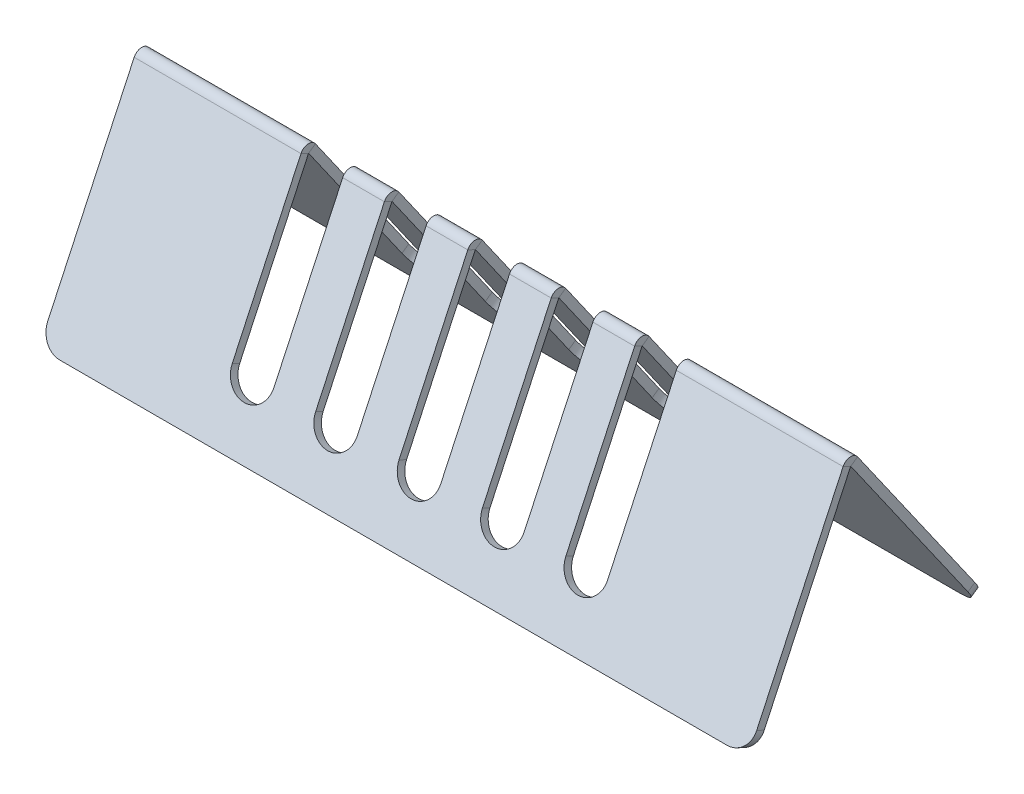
ISO-10303-21;
HEADER;
FILE_DESCRIPTION(('STEP AP214'),'2;1');
FILE_NAME('part.step','',(''),(''),'','','');
FILE_SCHEMA(('AUTOMOTIVE_DESIGN { 1 0 10303 214 1 1 1 1 }'));
ENDSEC;
DATA;
#1=APPLICATION_CONTEXT('core data for automotive mechanical design processes');
#2=APPLICATION_PROTOCOL_DEFINITION('international standard','automotive_design',2000,#1);
#3=PRODUCT_CONTEXT('',#1,'mechanical');
#4=PRODUCT('Part','Part','',(#3));
#5=PRODUCT_RELATED_PRODUCT_CATEGORY('part','',(#4));
#6=PRODUCT_DEFINITION_FORMATION('','',#4);
#7=PRODUCT_DEFINITION_CONTEXT('part definition',#1,'design');
#8=PRODUCT_DEFINITION('design','',#6,#7);
#9=PRODUCT_DEFINITION_SHAPE('','',#8);
#10=(LENGTH_UNIT() NAMED_UNIT(*) SI_UNIT(.MILLI.,.METRE.));
#11=(NAMED_UNIT(*) PLANE_ANGLE_UNIT() SI_UNIT($,.RADIAN.));
#12=(NAMED_UNIT(*) SI_UNIT($,.STERADIAN.) SOLID_ANGLE_UNIT());
#13=UNCERTAINTY_MEASURE_WITH_UNIT(LENGTH_MEASURE(1.E-05),#10,'distance_accuracy_value','');
#14=(GEOMETRIC_REPRESENTATION_CONTEXT(3) GLOBAL_UNCERTAINTY_ASSIGNED_CONTEXT((#13)) GLOBAL_UNIT_ASSIGNED_CONTEXT((#10,
#11,#12)) REPRESENTATION_CONTEXT('',''));
#15=CARTESIAN_POINT('',(0.,0.,0.));
#16=DIRECTION('',(0.,0.,1.));
#17=DIRECTION('',(1.,0.,0.));
#18=AXIS2_PLACEMENT_3D('',#15,#16,#17);
#19=CARTESIAN_POINT('',(170.,110.069394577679,-55.4982169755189));
#20=DIRECTION('',(-1.,0.,0.));
#21=DIRECTION('',(0.,0.90630778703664,-0.422618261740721));
#22=AXIS2_PLACEMENT_3D('',#19,#20,#21);
#23=PLANE('',#22);
#24=DIRECTION('',(0.,-0.90630778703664,0.422618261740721));
#25=VECTOR('',#24,1.);
#26=CARTESIAN_POINT('',(170.,110.069394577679,-55.4982169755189));
#27=LINE('',#26,#25);
#28=CARTESIAN_POINT('',(170.,59.3375273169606,-31.8415587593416));
#29=VERTEX_POINT('',#28);
#30=CARTESIAN_POINT('',(170.,14.9070769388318,-11.1232994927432));
#31=VERTEX_POINT('',#30);
#32=EDGE_CURVE('E39',#29,#31,#27,.T.);
#33=ORIENTED_EDGE('',*,*,#32,.F.);
#34=DIRECTION('',(0.,0.422618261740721,0.90630778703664));
#35=VECTOR('',#34,1.);
#36=CARTESIAN_POINT('',(170.,59.3375273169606,-31.8415587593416));
#37=LINE('',#36,#35);
#38=CARTESIAN_POINT('',(170.,60.182763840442,-30.0289431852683));
#39=VERTEX_POINT('',#38);
#40=EDGE_CURVE('E529',#29,#39,#37,.T.);
#41=ORIENTED_EDGE('',*,*,#40,.T.);
#42=DIRECTION('',(0.,-0.90630778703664,0.422618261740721));
#43=VECTOR('',#42,1.);
#44=CARTESIAN_POINT('',(170.,110.91463110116,-53.6856014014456));
#45=LINE('',#44,#43);
#46=CARTESIAN_POINT('',(170.,15.7523134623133,-9.3106839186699));
#47=VERTEX_POINT('',#46);
#48=EDGE_CURVE('E504',#39,#47,#45,.T.);
#49=ORIENTED_EDGE('',*,*,#48,.T.);
#50=DIRECTION('',(0.,0.422618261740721,0.90630778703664));
#51=VECTOR('',#50,1.);
#52=CARTESIAN_POINT('',(170.,14.9070769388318,-11.1232994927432));
#53=LINE('',#52,#51);
#54=EDGE_CURVE('E509',#31,#47,#53,.T.);
#55=ORIENTED_EDGE('',*,*,#54,.F.);
#56=EDGE_LOOP('',(#33,#41,#49,#55));
#57=FACE_BOUND('',#56,.T.);
#58=ADVANCED_FACE('F36',(#57),#23,.F.);
#59=CARTESIAN_POINT('',(0.,110.069394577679,-55.4982169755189));
#60=DIRECTION('',(1.,0.,0.));
#61=DIRECTION('',(0.,-0.90630778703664,0.422618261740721));
#62=AXIS2_PLACEMENT_3D('',#59,#60,#61);
#63=PLANE('',#62);
#64=DIRECTION('',(0.,0.90630778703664,-0.422618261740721));
#65=VECTOR('',#64,1.);
#66=CARTESIAN_POINT('',(0.,110.91463110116,-53.6856014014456));
#67=LINE('',#66,#65);
#68=CARTESIAN_POINT('',(0.,15.7523134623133,-9.31068391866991));
#69=VERTEX_POINT('',#68);
#70=CARTESIAN_POINT('',(0.,60.182763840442,-30.0289431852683));
#71=VERTEX_POINT('',#70);
#72=EDGE_CURVE('E60',#69,#71,#67,.T.);
#73=ORIENTED_EDGE('',*,*,#72,.T.);
#74=DIRECTION('',(0.,-0.422618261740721,-0.90630778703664));
#75=VECTOR('',#74,1.);
#76=CARTESIAN_POINT('',(0.,59.3375273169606,-31.8415587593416));
#77=LINE('',#76,#75);
#78=CARTESIAN_POINT('',(0.,59.3375273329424,-31.8415587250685));
#79=VERTEX_POINT('',#78);
#80=EDGE_CURVE('E580',#71,#79,#77,.T.);
#81=ORIENTED_EDGE('',*,*,#80,.T.);
#82=DIRECTION('',(0.,0.90630778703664,-0.422618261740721));
#83=VECTOR('',#82,1.);
#84=CARTESIAN_POINT('',(0.,110.069394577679,-55.4982169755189));
#85=LINE('',#84,#83);
#86=CARTESIAN_POINT('',(0.,14.9070769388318,-11.1232994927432));
#87=VERTEX_POINT('',#86);
#88=EDGE_CURVE('E508',#87,#79,#85,.T.);
#89=ORIENTED_EDGE('',*,*,#88,.F.);
#90=DIRECTION('',(0.,0.422618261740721,0.90630778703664));
#91=VECTOR('',#90,1.);
#92=CARTESIAN_POINT('',(0.,14.9070769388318,-11.1232994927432));
#93=LINE('',#92,#91);
#94=EDGE_CURVE('E512',#87,#69,#93,.T.);
#95=ORIENTED_EDGE('',*,*,#94,.T.);
#96=EDGE_LOOP('',(#73,#81,#89,#95));
#97=FACE_BOUND('',#96,.T.);
#98=ADVANCED_FACE('F964',(#97),#63,.F.);
#99=CARTESIAN_POINT('',(165.,15.7523134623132,-9.31068391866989));
#100=DIRECTION('',(0.,-0.422618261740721,-0.90630778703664));
#101=DIRECTION('',(0.,0.90630778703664,-0.422618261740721));
#102=AXIS2_PLACEMENT_3D('',#99,#100,#101);
#103=PLANE('',#102);
#104=ORIENTED_EDGE('',*,*,#48,.F.);
#105=DIRECTION('',(-1.,0.,0.));
#106=VECTOR('',#105,1.);
#107=CARTESIAN_POINT('',(165.,60.182763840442,-30.0289431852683));
#108=LINE('',#107,#106);
#109=CARTESIAN_POINT('',(130.,60.182763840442,-30.0289431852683));
#110=VERTEX_POINT('',#109);
#111=EDGE_CURVE('E526',#39,#110,#108,.T.);
#112=ORIENTED_EDGE('',*,*,#111,.T.);
#113=DIRECTION('',(0.,-0.90630778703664,0.422618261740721));
#114=VECTOR('',#113,1.);
#115=CARTESIAN_POINT('',(130.,101.851553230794,-49.4594187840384));
#116=LINE('',#115,#114);
#117=CARTESIAN_POINT('',(130.,24.8153913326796,-13.5368665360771));
#118=VERTEX_POINT('',#117);
#119=EDGE_CURVE('E485',#110,#118,#116,.T.);
#120=ORIENTED_EDGE('',*,*,#119,.T.);
#121=CARTESIAN_POINT('',(125.,24.8153913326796,-13.5368665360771));
#122=DIRECTION('',(0.,-0.422618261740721,-0.90630778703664));
#123=DIRECTION('',(0.,0.90630778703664,-0.422618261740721));
#124=AXIS2_PLACEMENT_3D('',#121,#122,#123);
#125=CIRCLE('',#124,5.);
#126=CARTESIAN_POINT('',(120.,24.8153913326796,-13.5368665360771));
#127=VERTEX_POINT('',#126);
#128=EDGE_CURVE('E478',#118,#127,#125,.T.);
#129=ORIENTED_EDGE('',*,*,#128,.T.);
#130=DIRECTION('',(0.,0.90630778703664,-0.422618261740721));
#131=VECTOR('',#130,1.);
#132=CARTESIAN_POINT('',(120.,101.851553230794,-49.4594187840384));
#133=LINE('',#132,#131);
#134=CARTESIAN_POINT('',(120.,60.182763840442,-30.0289431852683));
#135=VERTEX_POINT('',#134);
#136=EDGE_CURVE('E481',#127,#135,#133,.T.);
#137=ORIENTED_EDGE('',*,*,#136,.T.);
#138=DIRECTION('',(-1.,0.,0.));
#139=VECTOR('',#138,1.);
#140=CARTESIAN_POINT('',(165.,60.182763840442,-30.0289431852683));
#141=LINE('',#140,#139);
#142=CARTESIAN_POINT('',(110.,60.182763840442,-30.0289431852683));
#143=VERTEX_POINT('',#142);
#144=EDGE_CURVE('E390',#135,#143,#141,.T.);
#145=ORIENTED_EDGE('',*,*,#144,.T.);
#146=DIRECTION('',(0.,-0.90630778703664,0.422618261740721));
#147=VECTOR('',#146,1.);
#148=CARTESIAN_POINT('',(110.,101.851553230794,-49.4594187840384));
#149=LINE('',#148,#147);
#150=CARTESIAN_POINT('',(110.,24.8153913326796,-13.5368665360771));
#151=VERTEX_POINT('',#150);
#152=EDGE_CURVE('E470',#143,#151,#149,.T.);
#153=ORIENTED_EDGE('',*,*,#152,.T.);
#154=CARTESIAN_POINT('',(105.,24.8153913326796,-13.5368665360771));
#155=DIRECTION('',(0.,-0.422618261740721,-0.90630778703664));
#156=DIRECTION('',(0.,0.90630778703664,-0.422618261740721));
#157=AXIS2_PLACEMENT_3D('',#154,#155,#156);
#158=CIRCLE('',#157,5.);
#159=CARTESIAN_POINT('',(100.,24.8153913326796,-13.5368665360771));
#160=VERTEX_POINT('',#159);
#161=EDGE_CURVE('E463',#151,#160,#158,.T.);
#162=ORIENTED_EDGE('',*,*,#161,.T.);
#163=DIRECTION('',(0.,0.90630778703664,-0.422618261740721));
#164=VECTOR('',#163,1.);
#165=CARTESIAN_POINT('',(100.,101.851553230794,-49.4594187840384));
#166=LINE('',#165,#164);
#167=CARTESIAN_POINT('',(100.,60.182763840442,-30.0289431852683));
#168=VERTEX_POINT('',#167);
#169=EDGE_CURVE('E466',#160,#168,#166,.T.);
#170=ORIENTED_EDGE('',*,*,#169,.T.);
#171=DIRECTION('',(-1.,0.,0.));
#172=VECTOR('',#171,1.);
#173=CARTESIAN_POINT('',(165.,60.182763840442,-30.0289431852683));
#174=LINE('',#173,#172);
#175=CARTESIAN_POINT('',(90.,60.182763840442,-30.0289431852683));
#176=VERTEX_POINT('',#175);
#177=EDGE_CURVE('E547',#168,#176,#174,.T.);
#178=ORIENTED_EDGE('',*,*,#177,.T.);
#179=DIRECTION('',(0.,-0.90630778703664,0.422618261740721));
#180=VECTOR('',#179,1.);
#181=CARTESIAN_POINT('',(90.,101.851553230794,-49.4594187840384));
#182=LINE('',#181,#180);
#183=CARTESIAN_POINT('',(90.,24.8153913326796,-13.5368665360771));
#184=VERTEX_POINT('',#183);
#185=EDGE_CURVE('E455',#176,#184,#182,.T.);
#186=ORIENTED_EDGE('',*,*,#185,.T.);
#187=CARTESIAN_POINT('',(85.,24.8153913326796,-13.5368665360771));
#188=DIRECTION('',(0.,-0.422618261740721,-0.90630778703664));
#189=DIRECTION('',(0.,0.90630778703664,-0.422618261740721));
#190=AXIS2_PLACEMENT_3D('',#187,#188,#189);
#191=CIRCLE('',#190,5.);
#192=CARTESIAN_POINT('',(80.,24.8153913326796,-13.5368665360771));
#193=VERTEX_POINT('',#192);
#194=EDGE_CURVE('E448',#184,#193,#191,.T.);
#195=ORIENTED_EDGE('',*,*,#194,.T.);
#196=DIRECTION('',(0.,0.90630778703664,-0.422618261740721));
#197=VECTOR('',#196,1.);
#198=CARTESIAN_POINT('',(80.,101.851553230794,-49.4594187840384));
#199=LINE('',#198,#197);
#200=CARTESIAN_POINT('',(80.,60.182763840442,-30.0289431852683));
#201=VERTEX_POINT('',#200);
#202=EDGE_CURVE('E451',#193,#201,#199,.T.);
#203=ORIENTED_EDGE('',*,*,#202,.T.);
#204=DIRECTION('',(-1.,0.,0.));
#205=VECTOR('',#204,1.);
#206=CARTESIAN_POINT('',(165.,60.182763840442,-30.0289431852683));
#207=LINE('',#206,#205);
#208=CARTESIAN_POINT('',(70.,60.182763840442,-30.0289431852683));
#209=VERTEX_POINT('',#208);
#210=EDGE_CURVE('E559',#201,#209,#207,.T.);
#211=ORIENTED_EDGE('',*,*,#210,.T.);
#212=DIRECTION('',(0.,-0.90630778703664,0.422618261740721));
#213=VECTOR('',#212,1.);
#214=CARTESIAN_POINT('',(70.,101.851553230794,-49.4594187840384));
#215=LINE('',#214,#213);
#216=CARTESIAN_POINT('',(70.,24.8153913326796,-13.5368665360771));
#217=VERTEX_POINT('',#216);
#218=EDGE_CURVE('E440',#209,#217,#215,.T.);
#219=ORIENTED_EDGE('',*,*,#218,.T.);
#220=CARTESIAN_POINT('',(64.9999999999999,24.8153913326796,-13.5368665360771));
#221=DIRECTION('',(0.,-0.422618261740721,-0.90630778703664));
#222=DIRECTION('',(0.,0.90630778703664,-0.422618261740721));
#223=AXIS2_PLACEMENT_3D('',#220,#221,#222);
#224=CIRCLE('',#223,5.);
#225=CARTESIAN_POINT('',(60.,24.8153913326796,-13.5368665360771));
#226=VERTEX_POINT('',#225);
#227=EDGE_CURVE('E433',#217,#226,#224,.T.);
#228=ORIENTED_EDGE('',*,*,#227,.T.);
#229=DIRECTION('',(0.,0.90630778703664,-0.422618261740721));
#230=VECTOR('',#229,1.);
#231=CARTESIAN_POINT('',(60.,101.851553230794,-49.4594187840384));
#232=LINE('',#231,#230);
#233=CARTESIAN_POINT('',(60.,60.182763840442,-30.0289431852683));
#234=VERTEX_POINT('',#233);
#235=EDGE_CURVE('E436',#226,#234,#232,.T.);
#236=ORIENTED_EDGE('',*,*,#235,.T.);
#237=DIRECTION('',(-1.,0.,0.));
#238=VECTOR('',#237,1.);
#239=CARTESIAN_POINT('',(165.,60.182763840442,-30.0289431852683));
#240=LINE('',#239,#238);
#241=CARTESIAN_POINT('',(50.,60.182763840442,-30.0289431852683));
#242=VERTEX_POINT('',#241);
#243=EDGE_CURVE('E571',#234,#242,#240,.T.);
#244=ORIENTED_EDGE('',*,*,#243,.T.);
#245=DIRECTION('',(0.,-0.90630778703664,0.422618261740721));
#246=VECTOR('',#245,1.);
#247=CARTESIAN_POINT('',(50.,101.851553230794,-49.4594187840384));
#248=LINE('',#247,#246);
#249=CARTESIAN_POINT('',(50.,24.8153913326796,-13.5368665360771));
#250=VERTEX_POINT('',#249);
#251=EDGE_CURVE('E425',#242,#250,#248,.T.);
#252=ORIENTED_EDGE('',*,*,#251,.T.);
#253=CARTESIAN_POINT('',(45.,24.8153913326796,-13.5368665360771));
#254=DIRECTION('',(0.,-0.422618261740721,-0.90630778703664));
#255=DIRECTION('',(0.,0.90630778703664,-0.422618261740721));
#256=AXIS2_PLACEMENT_3D('',#253,#254,#255);
#257=CIRCLE('',#256,4.99999999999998);
#258=CARTESIAN_POINT('',(40.,24.8153913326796,-13.5368665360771));
#259=VERTEX_POINT('',#258);
#260=EDGE_CURVE('E420',#250,#259,#257,.T.);
#261=ORIENTED_EDGE('',*,*,#260,.T.);
#262=DIRECTION('',(0.,0.90630778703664,-0.422618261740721));
#263=VECTOR('',#262,1.);
#264=CARTESIAN_POINT('',(40.,101.851553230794,-49.4594187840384));
#265=LINE('',#264,#263);
#266=CARTESIAN_POINT('',(40.,60.182763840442,-30.0289431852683));
#267=VERTEX_POINT('',#266);
#268=EDGE_CURVE('E52',#259,#267,#265,.T.);
#269=ORIENTED_EDGE('',*,*,#268,.T.);
#270=DIRECTION('',(-1.,0.,0.));
#271=VECTOR('',#270,1.);
#272=CARTESIAN_POINT('',(165.,60.182763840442,-30.0289431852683));
#273=LINE('',#272,#271);
#274=EDGE_CURVE('E44',#267,#71,#273,.T.);
#275=ORIENTED_EDGE('',*,*,#274,.T.);
#276=ORIENTED_EDGE('',*,*,#72,.F.);
#277=CARTESIAN_POINT('',(5.00000000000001,15.7523134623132,-9.3106839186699));
#278=DIRECTION('',(0.,-0.422618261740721,-0.90630778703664));
#279=DIRECTION('',(0.,0.90630778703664,-0.422618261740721));
#280=AXIS2_PLACEMENT_3D('',#277,#278,#279);
#281=CIRCLE('',#280,5.);
#282=CARTESIAN_POINT('',(5.00000000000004,11.22077452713,-7.19759260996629));
#283=VERTEX_POINT('',#282);
#284=EDGE_CURVE('E498',#283,#69,#281,.T.);
#285=ORIENTED_EDGE('',*,*,#284,.F.);
#286=DIRECTION('',(-1.,0.,0.));
#287=VECTOR('',#286,1.);
#288=CARTESIAN_POINT('',(5.00000000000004,11.22077452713,-7.19759260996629));
#289=LINE('',#288,#287);
#290=CARTESIAN_POINT('',(165.,11.22077452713,-7.19759260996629));
#291=VERTEX_POINT('',#290);
#292=EDGE_CURVE('E496',#291,#283,#289,.T.);
#293=ORIENTED_EDGE('',*,*,#292,.F.);
#294=CARTESIAN_POINT('',(165.,15.7523134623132,-9.31068391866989));
#295=DIRECTION('',(0.,-0.422618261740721,-0.90630778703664));
#296=DIRECTION('',(0.,0.90630778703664,-0.422618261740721));
#297=AXIS2_PLACEMENT_3D('',#294,#295,#296);
#298=CIRCLE('',#297,5.);
#299=EDGE_CURVE('E493',#47,#291,#298,.T.);
#300=ORIENTED_EDGE('',*,*,#299,.F.);
#301=EDGE_LOOP('',(#104,#112,#120,#129,#137,#145,#153,#162,#170,#178,#186,#195,#203,#211,#219,
#228,#236,#244,#252,#261,#269,#275,#276,#285,#293,#300));
#302=FACE_BOUND('',#301,.T.);
#303=ADVANCED_FACE('F907',(#302),#103,.F.);
#304=CARTESIAN_POINT('',(165.,14.9070769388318,-11.1232994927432));
#305=DIRECTION('',(0.,-0.422618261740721,-0.90630778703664));
#306=DIRECTION('',(0.,0.90630778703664,-0.422618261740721));
#307=AXIS2_PLACEMENT_3D('',#304,#305,#306);
#308=PLANE('',#307);
#309=DIRECTION('',(-1.,0.,0.));
#310=VECTOR('',#309,1.);
#311=CARTESIAN_POINT('',(165.,59.3375273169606,-31.8415587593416));
#312=LINE('',#311,#310);
#313=CARTESIAN_POINT('',(130.,59.3375273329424,-31.8415587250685));
#314=VERTEX_POINT('',#313);
#315=EDGE_CURVE('E520',#29,#314,#312,.T.);
#316=ORIENTED_EDGE('',*,*,#315,.F.);
#317=ORIENTED_EDGE('',*,*,#32,.T.);
#318=CARTESIAN_POINT('',(165.,14.9070769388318,-11.1232994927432));
#319=DIRECTION('',(0.,-0.422618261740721,-0.90630778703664));
#320=DIRECTION('',(0.,0.90630778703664,-0.422618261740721));
#321=AXIS2_PLACEMENT_3D('',#318,#319,#320);
#322=CIRCLE('',#321,5.);
#323=CARTESIAN_POINT('',(165.,10.3755380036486,-9.01020818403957));
#324=VERTEX_POINT('',#323);
#325=EDGE_CURVE('E500',#31,#324,#322,.T.);
#326=ORIENTED_EDGE('',*,*,#325,.T.);
#327=DIRECTION('',(-1.,0.,0.));
#328=VECTOR('',#327,1.);
#329=CARTESIAN_POINT('',(5.00000000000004,10.3755380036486,-9.01020818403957));
#330=LINE('',#329,#328);
#331=CARTESIAN_POINT('',(5.00000000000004,10.3755380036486,-9.01020818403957));
#332=VERTEX_POINT('',#331);
#333=EDGE_CURVE('E503',#324,#332,#330,.T.);
#334=ORIENTED_EDGE('',*,*,#333,.T.);
#335=CARTESIAN_POINT('',(5.00000000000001,14.9070769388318,-11.1232994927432));
#336=DIRECTION('',(0.,-0.422618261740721,-0.90630778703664));
#337=DIRECTION('',(0.,0.90630778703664,-0.422618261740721));
#338=AXIS2_PLACEMENT_3D('',#335,#336,#337);
#339=CIRCLE('',#338,5.);
#340=EDGE_CURVE('E506',#332,#87,#339,.T.);
#341=ORIENTED_EDGE('',*,*,#340,.T.);
#342=ORIENTED_EDGE('',*,*,#88,.T.);
#343=DIRECTION('',(-1.,0.,0.));
#344=VECTOR('',#343,1.);
#345=CARTESIAN_POINT('',(165.,59.3375273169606,-31.8415587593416));
#346=LINE('',#345,#344);
#347=CARTESIAN_POINT('',(40.,59.3375273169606,-31.8415587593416));
#348=VERTEX_POINT('',#347);
#349=EDGE_CURVE('E577',#348,#79,#346,.T.);
#350=ORIENTED_EDGE('',*,*,#349,.F.);
#351=DIRECTION('',(0.,0.90630778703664,-0.422618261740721));
#352=VECTOR('',#351,1.);
#353=CARTESIAN_POINT('',(40.,101.006316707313,-51.2720343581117));
#354=LINE('',#353,#352);
#355=CARTESIAN_POINT('',(40.,23.9701548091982,-15.3494821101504));
#356=VERTEX_POINT('',#355);
#357=EDGE_CURVE('E424',#356,#348,#354,.T.);
#358=ORIENTED_EDGE('',*,*,#357,.F.);
#359=CARTESIAN_POINT('',(45.,23.9701548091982,-15.3494821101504));
#360=DIRECTION('',(0.,-0.422618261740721,-0.90630778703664));
#361=DIRECTION('',(0.,0.90630778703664,-0.422618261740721));
#362=AXIS2_PLACEMENT_3D('',#359,#360,#361);
#363=CIRCLE('',#362,4.99999999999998);
#364=CARTESIAN_POINT('',(50.,23.9701548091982,-15.3494821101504));
#365=VERTEX_POINT('',#364);
#366=EDGE_CURVE('E422',#365,#356,#363,.T.);
#367=ORIENTED_EDGE('',*,*,#366,.F.);
#368=DIRECTION('',(0.,-0.90630778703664,0.422618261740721));
#369=VECTOR('',#368,1.);
#370=CARTESIAN_POINT('',(50.,101.006316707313,-51.2720343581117));
#371=LINE('',#370,#369);
#372=CARTESIAN_POINT('',(50.,59.3375273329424,-31.8415587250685));
#373=VERTEX_POINT('',#372);
#374=EDGE_CURVE('E430',#373,#365,#371,.T.);
#375=ORIENTED_EDGE('',*,*,#374,.F.);
#376=DIRECTION('',(-1.,0.,0.));
#377=VECTOR('',#376,1.);
#378=CARTESIAN_POINT('',(165.,59.3375273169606,-31.8415587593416));
#379=LINE('',#378,#377);
#380=CARTESIAN_POINT('',(60.,59.3375273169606,-31.8415587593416));
#381=VERTEX_POINT('',#380);
#382=EDGE_CURVE('E565',#381,#373,#379,.T.);
#383=ORIENTED_EDGE('',*,*,#382,.F.);
#384=DIRECTION('',(0.,0.90630778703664,-0.422618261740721));
#385=VECTOR('',#384,1.);
#386=CARTESIAN_POINT('',(60.,101.006316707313,-51.2720343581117));
#387=LINE('',#386,#385);
#388=CARTESIAN_POINT('',(60.,23.9701548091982,-15.3494821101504));
#389=VERTEX_POINT('',#388);
#390=EDGE_CURVE('E439',#389,#381,#387,.T.);
#391=ORIENTED_EDGE('',*,*,#390,.F.);
#392=CARTESIAN_POINT('',(64.9999999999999,23.9701548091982,-15.3494821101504));
#393=DIRECTION('',(0.,-0.422618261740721,-0.90630778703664));
#394=DIRECTION('',(0.,0.90630778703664,-0.422618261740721));
#395=AXIS2_PLACEMENT_3D('',#392,#393,#394);
#396=CIRCLE('',#395,5.);
#397=CARTESIAN_POINT('',(70.,23.9701548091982,-15.3494821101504));
#398=VERTEX_POINT('',#397);
#399=EDGE_CURVE('E437',#398,#389,#396,.T.);
#400=ORIENTED_EDGE('',*,*,#399,.F.);
#401=DIRECTION('',(0.,-0.90630778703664,0.422618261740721));
#402=VECTOR('',#401,1.);
#403=CARTESIAN_POINT('',(70.,101.006316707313,-51.2720343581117));
#404=LINE('',#403,#402);
#405=CARTESIAN_POINT('',(70.,59.3375273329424,-31.8415587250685));
#406=VERTEX_POINT('',#405);
#407=EDGE_CURVE('E445',#406,#398,#404,.T.);
#408=ORIENTED_EDGE('',*,*,#407,.F.);
#409=DIRECTION('',(-1.,0.,0.));
#410=VECTOR('',#409,1.);
#411=CARTESIAN_POINT('',(165.,59.3375273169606,-31.8415587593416));
#412=LINE('',#411,#410);
#413=CARTESIAN_POINT('',(80.,59.3375273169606,-31.8415587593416));
#414=VERTEX_POINT('',#413);
#415=EDGE_CURVE('E553',#414,#406,#412,.T.);
#416=ORIENTED_EDGE('',*,*,#415,.F.);
#417=DIRECTION('',(0.,0.90630778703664,-0.422618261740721));
#418=VECTOR('',#417,1.);
#419=CARTESIAN_POINT('',(80.,101.006316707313,-51.2720343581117));
#420=LINE('',#419,#418);
#421=CARTESIAN_POINT('',(80.,23.9701548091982,-15.3494821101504));
#422=VERTEX_POINT('',#421);
#423=EDGE_CURVE('E454',#422,#414,#420,.T.);
#424=ORIENTED_EDGE('',*,*,#423,.F.);
#425=CARTESIAN_POINT('',(85.,23.9701548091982,-15.3494821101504));
#426=DIRECTION('',(0.,-0.422618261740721,-0.90630778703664));
#427=DIRECTION('',(0.,0.90630778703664,-0.422618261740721));
#428=AXIS2_PLACEMENT_3D('',#425,#426,#427);
#429=CIRCLE('',#428,5.);
#430=CARTESIAN_POINT('',(90.,23.9701548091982,-15.3494821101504));
#431=VERTEX_POINT('',#430);
#432=EDGE_CURVE('E452',#431,#422,#429,.T.);
#433=ORIENTED_EDGE('',*,*,#432,.F.);
#434=DIRECTION('',(0.,-0.90630778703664,0.422618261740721));
#435=VECTOR('',#434,1.);
#436=CARTESIAN_POINT('',(90.,101.006316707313,-51.2720343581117));
#437=LINE('',#436,#435);
#438=CARTESIAN_POINT('',(90.,59.3375273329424,-31.8415587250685));
#439=VERTEX_POINT('',#438);
#440=EDGE_CURVE('E460',#439,#431,#437,.T.);
#441=ORIENTED_EDGE('',*,*,#440,.F.);
#442=DIRECTION('',(-1.,0.,0.));
#443=VECTOR('',#442,1.);
#444=CARTESIAN_POINT('',(165.,59.3375273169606,-31.8415587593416));
#445=LINE('',#444,#443);
#446=CARTESIAN_POINT('',(100.,59.3375273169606,-31.8415587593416));
#447=VERTEX_POINT('',#446);
#448=EDGE_CURVE('E541',#447,#439,#445,.T.);
#449=ORIENTED_EDGE('',*,*,#448,.F.);
#450=DIRECTION('',(0.,0.90630778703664,-0.422618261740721));
#451=VECTOR('',#450,1.);
#452=CARTESIAN_POINT('',(100.,101.006316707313,-51.2720343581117));
#453=LINE('',#452,#451);
#454=CARTESIAN_POINT('',(100.,23.9701548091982,-15.3494821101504));
#455=VERTEX_POINT('',#454);
#456=EDGE_CURVE('E469',#455,#447,#453,.T.);
#457=ORIENTED_EDGE('',*,*,#456,.F.);
#458=CARTESIAN_POINT('',(105.,23.9701548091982,-15.3494821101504));
#459=DIRECTION('',(0.,-0.422618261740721,-0.90630778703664));
#460=DIRECTION('',(0.,0.90630778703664,-0.422618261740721));
#461=AXIS2_PLACEMENT_3D('',#458,#459,#460);
#462=CIRCLE('',#461,5.);
#463=CARTESIAN_POINT('',(110.,23.9701548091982,-15.3494821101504));
#464=VERTEX_POINT('',#463);
#465=EDGE_CURVE('E467',#464,#455,#462,.T.);
#466=ORIENTED_EDGE('',*,*,#465,.F.);
#467=DIRECTION('',(0.,-0.90630778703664,0.422618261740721));
#468=VECTOR('',#467,1.);
#469=CARTESIAN_POINT('',(110.,101.006316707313,-51.2720343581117));
#470=LINE('',#469,#468);
#471=CARTESIAN_POINT('',(110.,59.3375273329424,-31.8415587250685));
#472=VERTEX_POINT('',#471);
#473=EDGE_CURVE('E475',#472,#464,#470,.T.);
#474=ORIENTED_EDGE('',*,*,#473,.F.);
#475=DIRECTION('',(-1.,0.,0.));
#476=VECTOR('',#475,1.);
#477=CARTESIAN_POINT('',(165.,59.3375273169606,-31.8415587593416));
#478=LINE('',#477,#476);
#479=CARTESIAN_POINT('',(120.,59.3375273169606,-31.8415587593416));
#480=VERTEX_POINT('',#479);
#481=EDGE_CURVE('E532',#480,#472,#478,.T.);
#482=ORIENTED_EDGE('',*,*,#481,.F.);
#483=DIRECTION('',(0.,0.90630778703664,-0.422618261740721));
#484=VECTOR('',#483,1.);
#485=CARTESIAN_POINT('',(120.,101.006316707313,-51.2720343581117));
#486=LINE('',#485,#484);
#487=CARTESIAN_POINT('',(120.,23.9701548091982,-15.3494821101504));
#488=VERTEX_POINT('',#487);
#489=EDGE_CURVE('E484',#488,#480,#486,.T.);
#490=ORIENTED_EDGE('',*,*,#489,.F.);
#491=CARTESIAN_POINT('',(125.,23.9701548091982,-15.3494821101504));
#492=DIRECTION('',(0.,-0.422618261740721,-0.90630778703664));
#493=DIRECTION('',(0.,0.90630778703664,-0.422618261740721));
#494=AXIS2_PLACEMENT_3D('',#491,#492,#493);
#495=CIRCLE('',#494,5.);
#496=CARTESIAN_POINT('',(130.,23.9701548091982,-15.3494821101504));
#497=VERTEX_POINT('',#496);
#498=EDGE_CURVE('E482',#497,#488,#495,.T.);
#499=ORIENTED_EDGE('',*,*,#498,.F.);
#500=DIRECTION('',(0.,-0.90630778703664,0.422618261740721));
#501=VECTOR('',#500,1.);
#502=CARTESIAN_POINT('',(130.,101.006316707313,-51.2720343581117));
#503=LINE('',#502,#501);
#504=EDGE_CURVE('E490',#314,#497,#503,.T.);
#505=ORIENTED_EDGE('',*,*,#504,.F.);
#506=EDGE_LOOP('',(#316,#317,#326,#334,#341,#342,#350,#358,#367,#375,#383,#391,#400,#408,#416,
#424,#433,#441,#449,#457,#466,#474,#482,#490,#499,#505));
#507=FACE_BOUND('',#506,.T.);
#508=ADVANCED_FACE('F621',(#507),#308,.T.);
#509=CARTESIAN_POINT('',(165.,14.9070769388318,-11.1232994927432));
#510=DIRECTION('',(0.,0.422618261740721,0.90630778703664));
#511=DIRECTION('',(0.,-0.90630778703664,0.422618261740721));
#512=AXIS2_PLACEMENT_3D('',#509,#510,#511);
#513=CYLINDRICAL_SURFACE('',#512,5.);
#514=ORIENTED_EDGE('',*,*,#299,.T.);
#515=DIRECTION('',(0.,0.422618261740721,0.90630778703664));
#516=VECTOR('',#515,1.);
#517=CARTESIAN_POINT('',(165.,10.3755380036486,-9.01020818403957));
#518=LINE('',#517,#516);
#519=EDGE_CURVE('E517',#324,#291,#518,.T.);
#520=ORIENTED_EDGE('',*,*,#519,.F.);
#521=ORIENTED_EDGE('',*,*,#325,.F.);
#522=ORIENTED_EDGE('',*,*,#54,.T.);
#523=EDGE_LOOP('',(#514,#520,#521,#522));
#524=FACE_BOUND('',#523,.T.);
#525=ADVANCED_FACE('F1232',(#524),#513,.T.);
#526=CARTESIAN_POINT('',(5.00000000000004,10.3755380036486,-9.01020818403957));
#527=DIRECTION('',(0.,0.90630778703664,-0.422618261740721));
#528=DIRECTION('',(1.,0.,0.));
#529=AXIS2_PLACEMENT_3D('',#526,#527,#528);
#530=PLANE('',#529);
#531=ORIENTED_EDGE('',*,*,#292,.T.);
#532=DIRECTION('',(0.,0.422618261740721,0.90630778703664));
#533=VECTOR('',#532,1.);
#534=CARTESIAN_POINT('',(5.00000000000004,10.3755380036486,-9.01020818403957));
#535=LINE('',#534,#533);
#536=EDGE_CURVE('E514',#332,#283,#535,.T.);
#537=ORIENTED_EDGE('',*,*,#536,.F.);
#538=ORIENTED_EDGE('',*,*,#333,.F.);
#539=ORIENTED_EDGE('',*,*,#519,.T.);
#540=EDGE_LOOP('',(#531,#537,#538,#539));
#541=FACE_BOUND('',#540,.T.);
#542=ADVANCED_FACE('F1260',(#541),#530,.F.);
#543=CARTESIAN_POINT('',(5.00000000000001,14.9070769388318,-11.1232994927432));
#544=DIRECTION('',(0.,0.422618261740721,0.90630778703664));
#545=DIRECTION('',(0.,-0.90630778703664,0.422618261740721));
#546=AXIS2_PLACEMENT_3D('',#543,#544,#545);
#547=CYLINDRICAL_SURFACE('',#546,5.);
#548=ORIENTED_EDGE('',*,*,#284,.T.);
#549=ORIENTED_EDGE('',*,*,#94,.F.);
#550=ORIENTED_EDGE('',*,*,#340,.F.);
#551=ORIENTED_EDGE('',*,*,#536,.T.);
#552=EDGE_LOOP('',(#548,#549,#550,#551));
#553=FACE_BOUND('',#552,.T.);
#554=ADVANCED_FACE('F1271',(#553),#547,.T.);
#555=CARTESIAN_POINT('',(125.,23.9701548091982,-15.3494821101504));
#556=DIRECTION('',(0.,0.422618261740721,0.90630778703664));
#557=DIRECTION('',(0.,-0.90630778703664,0.422618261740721));
#558=AXIS2_PLACEMENT_3D('',#555,#556,#557);
#559=CYLINDRICAL_SURFACE('',#558,5.);
#560=ORIENTED_EDGE('',*,*,#128,.F.);
#561=DIRECTION('',(0.,0.422618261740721,0.90630778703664));
#562=VECTOR('',#561,1.);
#563=CARTESIAN_POINT('',(130.,23.9701548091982,-15.3494821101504));
#564=LINE('',#563,#562);
#565=EDGE_CURVE('E486',#497,#118,#564,.T.);
#566=ORIENTED_EDGE('',*,*,#565,.F.);
#567=ORIENTED_EDGE('',*,*,#498,.T.);
#568=DIRECTION('',(0.,0.422618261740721,0.90630778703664));
#569=VECTOR('',#568,1.);
#570=CARTESIAN_POINT('',(120.,23.9701548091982,-15.3494821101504));
#571=LINE('',#570,#569);
#572=EDGE_CURVE('E489',#488,#127,#571,.T.);
#573=ORIENTED_EDGE('',*,*,#572,.T.);
#574=EDGE_LOOP('',(#560,#566,#567,#573));
#575=FACE_BOUND('',#574,.T.);
#576=ADVANCED_FACE('F618',(#575),#559,.F.);
#577=CARTESIAN_POINT('',(120.,101.006316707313,-51.2720343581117));
#578=DIRECTION('',(1.,0.,0.));
#579=DIRECTION('',(0.,-0.90630778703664,0.422618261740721));
#580=AXIS2_PLACEMENT_3D('',#577,#578,#579);
#581=PLANE('',#580);
#582=DIRECTION('',(0.,-0.422618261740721,-0.90630778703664));
#583=VECTOR('',#582,1.);
#584=CARTESIAN_POINT('',(120.,59.3375273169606,-31.8415587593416));
#585=LINE('',#584,#583);
#586=EDGE_CURVE('E539',#135,#480,#585,.T.);
#587=ORIENTED_EDGE('',*,*,#586,.F.);
#588=ORIENTED_EDGE('',*,*,#136,.F.);
#589=ORIENTED_EDGE('',*,*,#572,.F.);
#590=ORIENTED_EDGE('',*,*,#489,.T.);
#591=EDGE_LOOP('',(#587,#588,#589,#590));
#592=FACE_BOUND('',#591,.T.);
#593=ADVANCED_FACE('F625',(#592),#581,.T.);
#594=CARTESIAN_POINT('',(130.,101.006316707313,-51.2720343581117));
#595=DIRECTION('',(-1.,0.,0.));
#596=DIRECTION('',(0.,0.90630778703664,-0.422618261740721));
#597=AXIS2_PLACEMENT_3D('',#594,#595,#596);
#598=PLANE('',#597);
#599=DIRECTION('',(0.,0.422618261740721,0.90630778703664));
#600=VECTOR('',#599,1.);
#601=CARTESIAN_POINT('',(130.,59.3375273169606,-31.8415587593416));
#602=LINE('',#601,#600);
#603=EDGE_CURVE('E523',#314,#110,#602,.T.);
#604=ORIENTED_EDGE('',*,*,#603,.F.);
#605=ORIENTED_EDGE('',*,*,#504,.T.);
#606=ORIENTED_EDGE('',*,*,#565,.T.);
#607=ORIENTED_EDGE('',*,*,#119,.F.);
#608=EDGE_LOOP('',(#604,#605,#606,#607));
#609=FACE_BOUND('',#608,.T.);
#610=ADVANCED_FACE('F613',(#609),#598,.T.);
#611=CARTESIAN_POINT('',(105.,23.9701548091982,-15.3494821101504));
#612=DIRECTION('',(0.,0.422618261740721,0.90630778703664));
#613=DIRECTION('',(0.,-0.90630778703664,0.422618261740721));
#614=AXIS2_PLACEMENT_3D('',#611,#612,#613);
#615=CYLINDRICAL_SURFACE('',#614,5.);
#616=ORIENTED_EDGE('',*,*,#161,.F.);
#617=DIRECTION('',(0.,0.422618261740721,0.90630778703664));
#618=VECTOR('',#617,1.);
#619=CARTESIAN_POINT('',(110.,23.9701548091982,-15.3494821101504));
#620=LINE('',#619,#618);
#621=EDGE_CURVE('E471',#464,#151,#620,.T.);
#622=ORIENTED_EDGE('',*,*,#621,.F.);
#623=ORIENTED_EDGE('',*,*,#465,.T.);
#624=DIRECTION('',(0.,0.422618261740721,0.90630778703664));
#625=VECTOR('',#624,1.);
#626=CARTESIAN_POINT('',(100.,23.9701548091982,-15.3494821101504));
#627=LINE('',#626,#625);
#628=EDGE_CURVE('E474',#455,#160,#627,.T.);
#629=ORIENTED_EDGE('',*,*,#628,.T.);
#630=EDGE_LOOP('',(#616,#622,#623,#629));
#631=FACE_BOUND('',#630,.T.);
#632=ADVANCED_FACE('F1136',(#631),#615,.F.);
#633=CARTESIAN_POINT('',(100.,101.006316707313,-51.2720343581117));
#634=DIRECTION('',(1.,0.,0.));
#635=DIRECTION('',(0.,-0.90630778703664,0.422618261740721));
#636=AXIS2_PLACEMENT_3D('',#633,#634,#635);
#637=PLANE('',#636);
#638=DIRECTION('',(0.,-0.422618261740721,-0.90630778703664));
#639=VECTOR('',#638,1.);
#640=CARTESIAN_POINT('',(100.,59.3375273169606,-31.8415587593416));
#641=LINE('',#640,#639);
#642=EDGE_CURVE('E550',#168,#447,#641,.T.);
#643=ORIENTED_EDGE('',*,*,#642,.F.);
#644=ORIENTED_EDGE('',*,*,#169,.F.);
#645=ORIENTED_EDGE('',*,*,#628,.F.);
#646=ORIENTED_EDGE('',*,*,#456,.T.);
#647=EDGE_LOOP('',(#643,#644,#645,#646));
#648=FACE_BOUND('',#647,.T.);
#649=ADVANCED_FACE('F1130',(#648),#637,.T.);
#650=CARTESIAN_POINT('',(110.,101.006316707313,-51.2720343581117));
#651=DIRECTION('',(-1.,0.,0.));
#652=DIRECTION('',(0.,0.90630778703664,-0.422618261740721));
#653=AXIS2_PLACEMENT_3D('',#650,#651,#652);
#654=PLANE('',#653);
#655=DIRECTION('',(0.,0.422618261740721,0.90630778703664));
#656=VECTOR('',#655,1.);
#657=CARTESIAN_POINT('',(110.,59.3375273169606,-31.8415587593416));
#658=LINE('',#657,#656);
#659=EDGE_CURVE('E535',#472,#143,#658,.T.);
#660=ORIENTED_EDGE('',*,*,#659,.F.);
#661=ORIENTED_EDGE('',*,*,#473,.T.);
#662=ORIENTED_EDGE('',*,*,#621,.T.);
#663=ORIENTED_EDGE('',*,*,#152,.F.);
#664=EDGE_LOOP('',(#660,#661,#662,#663));
#665=FACE_BOUND('',#664,.T.);
#666=ADVANCED_FACE('F1135',(#665),#654,.T.);
#667=CARTESIAN_POINT('',(85.,23.9701548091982,-15.3494821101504));
#668=DIRECTION('',(0.,0.422618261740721,0.90630778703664));
#669=DIRECTION('',(0.,-0.90630778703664,0.422618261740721));
#670=AXIS2_PLACEMENT_3D('',#667,#668,#669);
#671=CYLINDRICAL_SURFACE('',#670,5.);
#672=ORIENTED_EDGE('',*,*,#194,.F.);
#673=DIRECTION('',(0.,0.422618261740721,0.90630778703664));
#674=VECTOR('',#673,1.);
#675=CARTESIAN_POINT('',(90.,23.9701548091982,-15.3494821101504));
#676=LINE('',#675,#674);
#677=EDGE_CURVE('E456',#431,#184,#676,.T.);
#678=ORIENTED_EDGE('',*,*,#677,.F.);
#679=ORIENTED_EDGE('',*,*,#432,.T.);
#680=DIRECTION('',(0.,0.422618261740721,0.90630778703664));
#681=VECTOR('',#680,1.);
#682=CARTESIAN_POINT('',(80.,23.9701548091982,-15.3494821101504));
#683=LINE('',#682,#681);
#684=EDGE_CURVE('E459',#422,#193,#683,.T.);
#685=ORIENTED_EDGE('',*,*,#684,.T.);
#686=EDGE_LOOP('',(#672,#678,#679,#685));
#687=FACE_BOUND('',#686,.T.);
#688=ADVANCED_FACE('F1148',(#687),#671,.F.);
#689=CARTESIAN_POINT('',(80.,101.006316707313,-51.2720343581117));
#690=DIRECTION('',(1.,0.,0.));
#691=DIRECTION('',(0.,-0.90630778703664,0.422618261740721));
#692=AXIS2_PLACEMENT_3D('',#689,#690,#691);
#693=PLANE('',#692);
#694=DIRECTION('',(0.,-0.422618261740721,-0.90630778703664));
#695=VECTOR('',#694,1.);
#696=CARTESIAN_POINT('',(80.,59.3375273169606,-31.8415587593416));
#697=LINE('',#696,#695);
#698=EDGE_CURVE('E562',#201,#414,#697,.T.);
#699=ORIENTED_EDGE('',*,*,#698,.F.);
#700=ORIENTED_EDGE('',*,*,#202,.F.);
#701=ORIENTED_EDGE('',*,*,#684,.F.);
#702=ORIENTED_EDGE('',*,*,#423,.T.);
#703=EDGE_LOOP('',(#699,#700,#701,#702));
#704=FACE_BOUND('',#703,.T.);
#705=ADVANCED_FACE('F904',(#704),#693,.T.);
#706=CARTESIAN_POINT('',(90.,101.006316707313,-51.2720343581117));
#707=DIRECTION('',(-1.,0.,0.));
#708=DIRECTION('',(0.,0.90630778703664,-0.422618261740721));
#709=AXIS2_PLACEMENT_3D('',#706,#707,#708);
#710=PLANE('',#709);
#711=DIRECTION('',(0.,0.422618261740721,0.90630778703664));
#712=VECTOR('',#711,1.);
#713=CARTESIAN_POINT('',(90.,59.3375273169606,-31.8415587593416));
#714=LINE('',#713,#712);
#715=EDGE_CURVE('E544',#439,#176,#714,.T.);
#716=ORIENTED_EDGE('',*,*,#715,.F.);
#717=ORIENTED_EDGE('',*,*,#440,.T.);
#718=ORIENTED_EDGE('',*,*,#677,.T.);
#719=ORIENTED_EDGE('',*,*,#185,.F.);
#720=EDGE_LOOP('',(#716,#717,#718,#719));
#721=FACE_BOUND('',#720,.T.);
#722=ADVANCED_FACE('F1019',(#721),#710,.T.);
#723=CARTESIAN_POINT('',(64.9999999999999,23.9701548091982,-15.3494821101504));
#724=DIRECTION('',(0.,0.422618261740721,0.90630778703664));
#725=DIRECTION('',(0.,-0.90630778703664,0.422618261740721));
#726=AXIS2_PLACEMENT_3D('',#723,#724,#725);
#727=CYLINDRICAL_SURFACE('',#726,5.);
#728=ORIENTED_EDGE('',*,*,#227,.F.);
#729=DIRECTION('',(0.,0.422618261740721,0.90630778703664));
#730=VECTOR('',#729,1.);
#731=CARTESIAN_POINT('',(70.,23.9701548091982,-15.3494821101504));
#732=LINE('',#731,#730);
#733=EDGE_CURVE('E441',#398,#217,#732,.T.);
#734=ORIENTED_EDGE('',*,*,#733,.F.);
#735=ORIENTED_EDGE('',*,*,#399,.T.);
#736=DIRECTION('',(0.,0.422618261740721,0.90630778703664));
#737=VECTOR('',#736,1.);
#738=CARTESIAN_POINT('',(60.,23.9701548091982,-15.3494821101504));
#739=LINE('',#738,#737);
#740=EDGE_CURVE('E444',#389,#226,#739,.T.);
#741=ORIENTED_EDGE('',*,*,#740,.T.);
#742=EDGE_LOOP('',(#728,#734,#735,#741));
#743=FACE_BOUND('',#742,.T.);
#744=ADVANCED_FACE('F917',(#743),#727,.F.);
#745=CARTESIAN_POINT('',(60.,101.006316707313,-51.2720343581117));
#746=DIRECTION('',(1.,0.,0.));
#747=DIRECTION('',(0.,-0.90630778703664,0.422618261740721));
#748=AXIS2_PLACEMENT_3D('',#745,#746,#747);
#749=PLANE('',#748);
#750=DIRECTION('',(0.,-0.422618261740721,-0.90630778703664));
#751=VECTOR('',#750,1.);
#752=CARTESIAN_POINT('',(60.,59.3375273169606,-31.8415587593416));
#753=LINE('',#752,#751);
#754=EDGE_CURVE('E574',#234,#381,#753,.T.);
#755=ORIENTED_EDGE('',*,*,#754,.F.);
#756=ORIENTED_EDGE('',*,*,#235,.F.);
#757=ORIENTED_EDGE('',*,*,#740,.F.);
#758=ORIENTED_EDGE('',*,*,#390,.T.);
#759=EDGE_LOOP('',(#755,#756,#757,#758));
#760=FACE_BOUND('',#759,.T.);
#761=ADVANCED_FACE('F920',(#760),#749,.T.);
#762=CARTESIAN_POINT('',(70.,101.006316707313,-51.2720343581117));
#763=DIRECTION('',(-1.,0.,0.));
#764=DIRECTION('',(0.,0.90630778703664,-0.422618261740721));
#765=AXIS2_PLACEMENT_3D('',#762,#763,#764);
#766=PLANE('',#765);
#767=DIRECTION('',(0.,0.422618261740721,0.90630778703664));
#768=VECTOR('',#767,1.);
#769=CARTESIAN_POINT('',(70.,59.3375273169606,-31.8415587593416));
#770=LINE('',#769,#768);
#771=EDGE_CURVE('E556',#406,#209,#770,.T.);
#772=ORIENTED_EDGE('',*,*,#771,.F.);
#773=ORIENTED_EDGE('',*,*,#407,.T.);
#774=ORIENTED_EDGE('',*,*,#733,.T.);
#775=ORIENTED_EDGE('',*,*,#218,.F.);
#776=EDGE_LOOP('',(#772,#773,#774,#775));
#777=FACE_BOUND('',#776,.T.);
#778=ADVANCED_FACE('F911',(#777),#766,.T.);
#779=CARTESIAN_POINT('',(45.,23.9701548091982,-15.3494821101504));
#780=DIRECTION('',(0.,0.422618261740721,0.90630778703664));
#781=DIRECTION('',(0.,-0.90630778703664,0.422618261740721));
#782=AXIS2_PLACEMENT_3D('',#779,#780,#781);
#783=CYLINDRICAL_SURFACE('',#782,4.99999999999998);
#784=ORIENTED_EDGE('',*,*,#260,.F.);
#785=DIRECTION('',(0.,0.422618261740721,0.90630778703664));
#786=VECTOR('',#785,1.);
#787=CARTESIAN_POINT('',(50.,23.9701548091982,-15.3494821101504));
#788=LINE('',#787,#786);
#789=EDGE_CURVE('E426',#365,#250,#788,.T.);
#790=ORIENTED_EDGE('',*,*,#789,.F.);
#791=ORIENTED_EDGE('',*,*,#366,.T.);
#792=DIRECTION('',(0.,0.422618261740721,0.90630778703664));
#793=VECTOR('',#792,1.);
#794=CARTESIAN_POINT('',(40.,23.9701548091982,-15.3494821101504));
#795=LINE('',#794,#793);
#796=EDGE_CURVE('E429',#356,#259,#795,.T.);
#797=ORIENTED_EDGE('',*,*,#796,.T.);
#798=EDGE_LOOP('',(#784,#790,#791,#797));
#799=FACE_BOUND('',#798,.T.);
#800=ADVANCED_FACE('F1189',(#799),#783,.F.);
#801=CARTESIAN_POINT('',(40.,101.006316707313,-51.2720343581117));
#802=DIRECTION('',(1.,0.,0.));
#803=DIRECTION('',(0.,-0.90630778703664,0.422618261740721));
#804=AXIS2_PLACEMENT_3D('',#801,#802,#803);
#805=PLANE('',#804);
#806=DIRECTION('',(0.,-0.422618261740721,-0.90630778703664));
#807=VECTOR('',#806,1.);
#808=CARTESIAN_POINT('',(40.,59.3375273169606,-31.8415587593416));
#809=LINE('',#808,#807);
#810=EDGE_CURVE('E12',#267,#348,#809,.T.);
#811=ORIENTED_EDGE('',*,*,#810,.F.);
#812=ORIENTED_EDGE('',*,*,#268,.F.);
#813=ORIENTED_EDGE('',*,*,#796,.F.);
#814=ORIENTED_EDGE('',*,*,#357,.T.);
#815=EDGE_LOOP('',(#811,#812,#813,#814));
#816=FACE_BOUND('',#815,.T.);
#817=ADVANCED_FACE('F1211',(#816),#805,.T.);
#818=CARTESIAN_POINT('',(50.,101.006316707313,-51.2720343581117));
#819=DIRECTION('',(-1.,0.,0.));
#820=DIRECTION('',(0.,0.90630778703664,-0.422618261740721));
#821=AXIS2_PLACEMENT_3D('',#818,#819,#820);
#822=PLANE('',#821);
#823=DIRECTION('',(0.,0.422618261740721,0.90630778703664));
#824=VECTOR('',#823,1.);
#825=CARTESIAN_POINT('',(50.,59.3375273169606,-31.8415587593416));
#826=LINE('',#825,#824);
#827=EDGE_CURVE('E568',#373,#242,#826,.T.);
#828=ORIENTED_EDGE('',*,*,#827,.F.);
#829=ORIENTED_EDGE('',*,*,#374,.T.);
#830=ORIENTED_EDGE('',*,*,#789,.T.);
#831=ORIENTED_EDGE('',*,*,#251,.F.);
#832=EDGE_LOOP('',(#828,#829,#830,#831));
#833=FACE_BOUND('',#832,.T.);
#834=ADVANCED_FACE('F1205',(#833),#822,.T.);
#835=CARTESIAN_POINT('',(165.,19.1812728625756,-59.9775824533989));
#836=DIRECTION('',(0.,0.573576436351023,-0.819152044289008));
#837=DIRECTION('',(0.,0.819152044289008,0.573576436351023));
#838=AXIS2_PLACEMENT_3D('',#835,#836,#837);
#839=CYLINDRICAL_SURFACE('',#838,5.);
#840=CARTESIAN_POINT('',(165.,20.3284257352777,-61.6158865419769));
#841=DIRECTION('',(0.,-0.573576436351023,0.819152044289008));
#842=DIRECTION('',(0.,-0.819152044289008,-0.573576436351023));
#843=AXIS2_PLACEMENT_3D('',#840,#841,#842);
#844=CIRCLE('',#843,5.);
#845=CARTESIAN_POINT('',(165.,16.2326655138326,-64.483768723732));
#846=VERTEX_POINT('',#845);
#847=CARTESIAN_POINT('',(170.,20.3284257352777,-61.6158865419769));
#848=VERTEX_POINT('',#847);
#849=EDGE_CURVE('E857',#846,#848,#844,.T.);
#850=ORIENTED_EDGE('',*,*,#849,.T.);
#851=DIRECTION('',(0.,0.573576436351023,-0.819152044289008));
#852=VECTOR('',#851,1.);
#853=CARTESIAN_POINT('',(170.,19.1812728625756,-59.9775824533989));
#854=LINE('',#853,#852);
#855=CARTESIAN_POINT('',(170.,19.1812728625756,-59.9775824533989));
#856=VERTEX_POINT('',#855);
#857=EDGE_CURVE('E750',#856,#848,#854,.T.);
#858=ORIENTED_EDGE('',*,*,#857,.F.);
#859=CARTESIAN_POINT('',(165.,19.1812728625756,-59.9775824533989));
#860=DIRECTION('',(0.,-0.573576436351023,0.819152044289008));
#861=DIRECTION('',(0.,-0.819152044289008,-0.573576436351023));
#862=AXIS2_PLACEMENT_3D('',#859,#860,#861);
#863=CIRCLE('',#862,5.);
#864=CARTESIAN_POINT('',(165.,15.0855126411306,-62.845464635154));
#865=VERTEX_POINT('',#864);
#866=EDGE_CURVE('E792',#865,#856,#863,.T.);
#867=ORIENTED_EDGE('',*,*,#866,.F.);
#868=DIRECTION('',(0.,0.573576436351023,-0.819152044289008));
#869=VECTOR('',#868,1.);
#870=CARTESIAN_POINT('',(165.,15.0855126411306,-62.845464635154));
#871=LINE('',#870,#869);
#872=EDGE_CURVE('E854',#865,#846,#871,.T.);
#873=ORIENTED_EDGE('',*,*,#872,.T.);
#874=EDGE_LOOP('',(#850,#858,#867,#873));
#875=FACE_BOUND('',#874,.T.);
#876=ADVANCED_FACE('F1210',(#875),#839,.T.);
#877=CARTESIAN_POINT('',(5.00000000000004,15.0855126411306,-62.845464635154));
#878=DIRECTION('',(0.,0.819152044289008,0.573576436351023));
#879=DIRECTION('',(-1.,0.,0.));
#880=AXIS2_PLACEMENT_3D('',#877,#878,#879);
#881=PLANE('',#880);
#882=DIRECTION('',(1.,0.,0.));
#883=VECTOR('',#882,1.);
#884=CARTESIAN_POINT('',(5.00000000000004,16.2326655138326,-64.483768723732));
#885=LINE('',#884,#883);
#886=CARTESIAN_POINT('',(5.00000000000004,16.2326655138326,-64.483768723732));
#887=VERTEX_POINT('',#886);
#888=EDGE_CURVE('E852',#887,#846,#885,.T.);
#889=ORIENTED_EDGE('',*,*,#888,.T.);
#890=ORIENTED_EDGE('',*,*,#872,.F.);
#891=DIRECTION('',(1.,0.,0.));
#892=VECTOR('',#891,1.);
#893=CARTESIAN_POINT('',(5.00000000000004,15.0855126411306,-62.845464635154));
#894=LINE('',#893,#892);
#895=CARTESIAN_POINT('',(5.00000000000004,15.0855126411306,-62.845464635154));
#896=VERTEX_POINT('',#895);
#897=EDGE_CURVE('E794',#896,#865,#894,.T.);
#898=ORIENTED_EDGE('',*,*,#897,.F.);
#899=DIRECTION('',(0.,0.573576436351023,-0.819152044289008));
#900=VECTOR('',#899,1.);
#901=CARTESIAN_POINT('',(5.00000000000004,15.0855126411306,-62.845464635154));
#902=LINE('',#901,#900);
#903=EDGE_CURVE('E849',#896,#887,#902,.T.);
#904=ORIENTED_EDGE('',*,*,#903,.T.);
#905=EDGE_LOOP('',(#889,#890,#898,#904));
#906=FACE_BOUND('',#905,.T.);
#907=ADVANCED_FACE('F1334',(#906),#881,.F.);
#908=CARTESIAN_POINT('',(5.,19.1812728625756,-59.9775824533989));
#909=DIRECTION('',(0.,0.573576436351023,-0.819152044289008));
#910=DIRECTION('',(0.,0.819152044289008,0.573576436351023));
#911=AXIS2_PLACEMENT_3D('',#908,#909,#910);
#912=CYLINDRICAL_SURFACE('',#911,5.);
#913=CARTESIAN_POINT('',(5.,20.3284257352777,-61.6158865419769));
#914=DIRECTION('',(0.,-0.573576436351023,0.819152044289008));
#915=DIRECTION('',(0.,-0.819152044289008,-0.573576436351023));
#916=AXIS2_PLACEMENT_3D('',#913,#914,#915);
#917=CIRCLE('',#916,5.);
#918=CARTESIAN_POINT('',(0.,20.3284257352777,-61.6158865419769));
#919=VERTEX_POINT('',#918);
#920=EDGE_CURVE('E847',#919,#887,#917,.T.);
#921=ORIENTED_EDGE('',*,*,#920,.T.);
#922=ORIENTED_EDGE('',*,*,#903,.F.);
#923=CARTESIAN_POINT('',(5.,19.1812728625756,-59.9775824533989));
#924=DIRECTION('',(0.,-0.573576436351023,0.819152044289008));
#925=DIRECTION('',(0.,-0.819152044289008,-0.573576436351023));
#926=AXIS2_PLACEMENT_3D('',#923,#924,#925);
#927=CIRCLE('',#926,5.);
#928=CARTESIAN_POINT('',(0.,19.1812728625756,-59.9775824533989));
#929=VERTEX_POINT('',#928);
#930=EDGE_CURVE('E796',#929,#896,#927,.T.);
#931=ORIENTED_EDGE('',*,*,#930,.F.);
#932=DIRECTION('',(0.,0.573576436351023,-0.819152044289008));
#933=VECTOR('',#932,1.);
#934=CARTESIAN_POINT('',(0.,19.1812728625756,-59.9775824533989));
#935=LINE('',#934,#933);
#936=EDGE_CURVE('E844',#929,#919,#935,.T.);
#937=ORIENTED_EDGE('',*,*,#936,.T.);
#938=EDGE_LOOP('',(#921,#922,#931,#937));
#939=FACE_BOUND('',#938,.T.);
#940=ADVANCED_FACE('F1345',(#939),#912,.T.);
#941=CARTESIAN_POINT('',(45.,27.3727933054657,-54.2418180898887));
#942=DIRECTION('',(0.,0.573576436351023,-0.819152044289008));
#943=DIRECTION('',(0.,0.819152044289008,0.573576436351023));
#944=AXIS2_PLACEMENT_3D('',#941,#942,#943);
#945=CYLINDRICAL_SURFACE('',#944,4.99999999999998);
#946=CARTESIAN_POINT('',(45.,28.5199461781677,-55.8801221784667));
#947=DIRECTION('',(0.,-0.573576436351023,0.819152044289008));
#948=DIRECTION('',(0.,-0.819152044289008,-0.573576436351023));
#949=AXIS2_PLACEMENT_3D('',#946,#947,#948);
#950=CIRCLE('',#949,4.99999999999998);
#951=CARTESIAN_POINT('',(40.,28.5199461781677,-55.8801221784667));
#952=VERTEX_POINT('',#951);
#953=CARTESIAN_POINT('',(50.,28.5199461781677,-55.8801221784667));
#954=VERTEX_POINT('',#953);
#955=EDGE_CURVE('E781',#952,#954,#950,.T.);
#956=ORIENTED_EDGE('',*,*,#955,.F.);
#957=DIRECTION('',(0.,0.573576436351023,-0.819152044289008));
#958=VECTOR('',#957,1.);
#959=CARTESIAN_POINT('',(40.,27.3727933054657,-54.2418180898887));
#960=LINE('',#959,#958);
#961=CARTESIAN_POINT('',(40.,27.3727933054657,-54.2418180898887));
#962=VERTEX_POINT('',#961);
#963=EDGE_CURVE('E737',#962,#952,#960,.T.);
#964=ORIENTED_EDGE('',*,*,#963,.F.);
#965=CARTESIAN_POINT('',(45.,27.3727933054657,-54.2418180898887));
#966=DIRECTION('',(0.,-0.573576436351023,0.819152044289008));
#967=DIRECTION('',(0.,-0.819152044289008,-0.573576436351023));
#968=AXIS2_PLACEMENT_3D('',#965,#966,#967);
#969=CIRCLE('',#968,4.99999999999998);
#970=CARTESIAN_POINT('',(50.,27.3727933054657,-54.2418180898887));
#971=VERTEX_POINT('',#970);
#972=EDGE_CURVE('E841',#962,#971,#969,.T.);
#973=ORIENTED_EDGE('',*,*,#972,.T.);
#974=DIRECTION('',(0.,0.573576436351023,-0.819152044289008));
#975=VECTOR('',#974,1.);
#976=CARTESIAN_POINT('',(50.,27.3727933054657,-54.2418180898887));
#977=LINE('',#976,#975);
#978=EDGE_CURVE('E839',#971,#954,#977,.T.);
#979=ORIENTED_EDGE('',*,*,#978,.T.);
#980=EDGE_LOOP('',(#956,#964,#973,#979));
#981=FACE_BOUND('',#980,.T.);
#982=ADVANCED_FACE('F1356',(#981),#945,.F.);
#983=CARTESIAN_POINT('',(64.9999999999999,27.3727933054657,-54.2418180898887));
#984=DIRECTION('',(0.,0.573576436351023,-0.819152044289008));
#985=DIRECTION('',(0.,0.819152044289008,0.573576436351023));
#986=AXIS2_PLACEMENT_3D('',#983,#984,#985);
#987=CYLINDRICAL_SURFACE('',#986,5.);
#988=CARTESIAN_POINT('',(64.9999999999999,28.5199461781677,-55.8801221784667));
#989=DIRECTION('',(0.,-0.573576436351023,0.819152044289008));
#990=DIRECTION('',(0.,-0.819152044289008,-0.573576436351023));
#991=AXIS2_PLACEMENT_3D('',#988,#989,#990);
#992=CIRCLE('',#991,5.);
#993=CARTESIAN_POINT('',(59.9999999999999,28.5199461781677,-55.8801221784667));
#994=VERTEX_POINT('',#993);
#995=CARTESIAN_POINT('',(70.,28.5199461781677,-55.8801221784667));
#996=VERTEX_POINT('',#995);
#997=EDGE_CURVE('E773',#994,#996,#992,.T.);
#998=ORIENTED_EDGE('',*,*,#997,.F.);
#999=DIRECTION('',(0.,0.573576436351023,-0.819152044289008));
#1000=VECTOR('',#999,1.);
#1001=CARTESIAN_POINT('',(59.9999999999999,27.3727933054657,-54.2418180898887));
#1002=LINE('',#1001,#1000);
#1003=CARTESIAN_POINT('',(59.9999999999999,27.3727933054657,-54.2418180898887));
#1004=VERTEX_POINT('',#1003);
#1005=EDGE_CURVE('E723',#1004,#994,#1002,.T.);
#1006=ORIENTED_EDGE('',*,*,#1005,.F.);
#1007=CARTESIAN_POINT('',(64.9999999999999,27.3727933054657,-54.2418180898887));
#1008=DIRECTION('',(0.,-0.573576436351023,0.819152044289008));
#1009=DIRECTION('',(0.,-0.819152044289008,-0.573576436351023));
#1010=AXIS2_PLACEMENT_3D('',#1007,#1008,#1009);
#1011=CIRCLE('',#1010,5.);
#1012=CARTESIAN_POINT('',(70.,27.3727933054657,-54.2418180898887));
#1013=VERTEX_POINT('',#1012);
#1014=EDGE_CURVE('E836',#1004,#1013,#1011,.T.);
#1015=ORIENTED_EDGE('',*,*,#1014,.T.);
#1016=DIRECTION('',(0.,0.573576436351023,-0.819152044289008));
#1017=VECTOR('',#1016,1.);
#1018=CARTESIAN_POINT('',(70.,27.3727933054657,-54.2418180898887));
#1019=LINE('',#1018,#1017);
#1020=EDGE_CURVE('E834',#1013,#996,#1019,.T.);
#1021=ORIENTED_EDGE('',*,*,#1020,.T.);
#1022=EDGE_LOOP('',(#998,#1006,#1015,#1021));
#1023=FACE_BOUND('',#1022,.T.);
#1024=ADVANCED_FACE('F1367',(#1023),#987,.F.);
#1025=CARTESIAN_POINT('',(85.,27.3727933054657,-54.2418180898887));
#1026=DIRECTION('',(0.,0.573576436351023,-0.819152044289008));
#1027=DIRECTION('',(0.,0.819152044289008,0.573576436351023));
#1028=AXIS2_PLACEMENT_3D('',#1025,#1026,#1027);
#1029=CYLINDRICAL_SURFACE('',#1028,5.);
#1030=CARTESIAN_POINT('',(85.,28.5199461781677,-55.8801221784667));
#1031=DIRECTION('',(0.,-0.573576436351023,0.819152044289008));
#1032=DIRECTION('',(0.,-0.819152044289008,-0.573576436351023));
#1033=AXIS2_PLACEMENT_3D('',#1030,#1031,#1032);
#1034=CIRCLE('',#1033,5.);
#1035=CARTESIAN_POINT('',(80.,28.5199461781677,-55.8801221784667));
#1036=VERTEX_POINT('',#1035);
#1037=CARTESIAN_POINT('',(90.,28.5199461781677,-55.8801221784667));
#1038=VERTEX_POINT('',#1037);
#1039=EDGE_CURVE('E765',#1036,#1038,#1034,.T.);
#1040=ORIENTED_EDGE('',*,*,#1039,.F.);
#1041=DIRECTION('',(0.,0.573576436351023,-0.819152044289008));
#1042=VECTOR('',#1041,1.);
#1043=CARTESIAN_POINT('',(80.,27.3727933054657,-54.2418180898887));
#1044=LINE('',#1043,#1042);
#1045=CARTESIAN_POINT('',(80.,27.3727933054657,-54.2418180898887));
#1046=VERTEX_POINT('',#1045);
#1047=EDGE_CURVE('E709',#1046,#1036,#1044,.T.);
#1048=ORIENTED_EDGE('',*,*,#1047,.F.);
#1049=CARTESIAN_POINT('',(85.,27.3727933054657,-54.2418180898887));
#1050=DIRECTION('',(0.,-0.573576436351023,0.819152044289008));
#1051=DIRECTION('',(0.,-0.819152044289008,-0.573576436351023));
#1052=AXIS2_PLACEMENT_3D('',#1049,#1050,#1051);
#1053=CIRCLE('',#1052,5.);
#1054=CARTESIAN_POINT('',(90.,27.3727933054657,-54.2418180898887));
#1055=VERTEX_POINT('',#1054);
#1056=EDGE_CURVE('E831',#1046,#1055,#1053,.T.);
#1057=ORIENTED_EDGE('',*,*,#1056,.T.);
#1058=DIRECTION('',(0.,0.573576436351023,-0.819152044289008));
#1059=VECTOR('',#1058,1.);
#1060=CARTESIAN_POINT('',(90.,27.3727933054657,-54.2418180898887));
#1061=LINE('',#1060,#1059);
#1062=EDGE_CURVE('E829',#1055,#1038,#1061,.T.);
#1063=ORIENTED_EDGE('',*,*,#1062,.T.);
#1064=EDGE_LOOP('',(#1040,#1048,#1057,#1063));
#1065=FACE_BOUND('',#1064,.T.);
#1066=ADVANCED_FACE('F1378',(#1065),#1029,.F.);
#1067=CARTESIAN_POINT('',(105.,27.3727933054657,-54.2418180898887));
#1068=DIRECTION('',(0.,0.573576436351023,-0.819152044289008));
#1069=DIRECTION('',(0.,0.819152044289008,0.573576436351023));
#1070=AXIS2_PLACEMENT_3D('',#1067,#1068,#1069);
#1071=CYLINDRICAL_SURFACE('',#1070,5.);
#1072=CARTESIAN_POINT('',(105.,28.5199461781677,-55.8801221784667));
#1073=DIRECTION('',(0.,-0.573576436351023,0.819152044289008));
#1074=DIRECTION('',(0.,-0.819152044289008,-0.573576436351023));
#1075=AXIS2_PLACEMENT_3D('',#1072,#1073,#1074);
#1076=CIRCLE('',#1075,5.);
#1077=CARTESIAN_POINT('',(100.,28.5199461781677,-55.8801221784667));
#1078=VERTEX_POINT('',#1077);
#1079=CARTESIAN_POINT('',(110.,28.5199461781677,-55.8801221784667));
#1080=VERTEX_POINT('',#1079);
#1081=EDGE_CURVE('E758',#1078,#1080,#1076,.T.);
#1082=ORIENTED_EDGE('',*,*,#1081,.F.);
#1083=DIRECTION('',(0.,0.573576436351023,-0.819152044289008));
#1084=VECTOR('',#1083,1.);
#1085=CARTESIAN_POINT('',(100.,27.3727933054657,-54.2418180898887));
#1086=LINE('',#1085,#1084);
#1087=CARTESIAN_POINT('',(100.,27.3727933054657,-54.2418180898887));
#1088=VERTEX_POINT('',#1087);
#1089=EDGE_CURVE('E695',#1088,#1078,#1086,.T.);
#1090=ORIENTED_EDGE('',*,*,#1089,.F.);
#1091=CARTESIAN_POINT('',(105.,27.3727933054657,-54.2418180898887));
#1092=DIRECTION('',(0.,-0.573576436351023,0.819152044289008));
#1093=DIRECTION('',(0.,-0.819152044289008,-0.573576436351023));
#1094=AXIS2_PLACEMENT_3D('',#1091,#1092,#1093);
#1095=CIRCLE('',#1094,5.);
#1096=CARTESIAN_POINT('',(110.,27.3727933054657,-54.2418180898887));
#1097=VERTEX_POINT('',#1096);
#1098=EDGE_CURVE('E826',#1088,#1097,#1095,.T.);
#1099=ORIENTED_EDGE('',*,*,#1098,.T.);
#1100=DIRECTION('',(0.,0.573576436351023,-0.819152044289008));
#1101=VECTOR('',#1100,1.);
#1102=CARTESIAN_POINT('',(110.,27.3727933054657,-54.2418180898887));
#1103=LINE('',#1102,#1101);
#1104=EDGE_CURVE('E824',#1097,#1080,#1103,.T.);
#1105=ORIENTED_EDGE('',*,*,#1104,.T.);
#1106=EDGE_LOOP('',(#1082,#1090,#1099,#1105));
#1107=FACE_BOUND('',#1106,.T.);
#1108=ADVANCED_FACE('F998',(#1107),#1071,.F.);
#1109=CARTESIAN_POINT('',(125.,27.3727933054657,-54.2418180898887));
#1110=DIRECTION('',(0.,0.573576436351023,-0.819152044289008));
#1111=DIRECTION('',(0.,0.819152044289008,0.573576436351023));
#1112=AXIS2_PLACEMENT_3D('',#1109,#1110,#1111);
#1113=CYLINDRICAL_SURFACE('',#1112,5.);
#1114=CARTESIAN_POINT('',(125.,28.5199461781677,-55.8801221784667));
#1115=DIRECTION('',(0.,-0.573576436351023,0.819152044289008));
#1116=DIRECTION('',(0.,-0.819152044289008,-0.573576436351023));
#1117=AXIS2_PLACEMENT_3D('',#1114,#1115,#1116);
#1118=CIRCLE('',#1117,5.);
#1119=CARTESIAN_POINT('',(120.,28.5199461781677,-55.8801221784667));
#1120=VERTEX_POINT('',#1119);
#1121=CARTESIAN_POINT('',(130.,28.5199461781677,-55.8801221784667));
#1122=VERTEX_POINT('',#1121);
#1123=EDGE_CURVE('E401',#1120,#1122,#1118,.T.);
#1124=ORIENTED_EDGE('',*,*,#1123,.F.);
#1125=DIRECTION('',(0.,0.573576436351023,-0.819152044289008));
#1126=VECTOR('',#1125,1.);
#1127=CARTESIAN_POINT('',(120.,27.3727933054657,-54.2418180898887));
#1128=LINE('',#1127,#1126);
#1129=CARTESIAN_POINT('',(120.,27.3727933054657,-54.2418180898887));
#1130=VERTEX_POINT('',#1129);
#1131=EDGE_CURVE('E397',#1130,#1120,#1128,.T.);
#1132=ORIENTED_EDGE('',*,*,#1131,.F.);
#1133=CARTESIAN_POINT('',(125.,27.3727933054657,-54.2418180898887));
#1134=DIRECTION('',(0.,-0.573576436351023,0.819152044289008));
#1135=DIRECTION('',(0.,-0.819152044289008,-0.573576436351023));
#1136=AXIS2_PLACEMENT_3D('',#1133,#1134,#1135);
#1137=CIRCLE('',#1136,5.);
#1138=CARTESIAN_POINT('',(130.,27.3727933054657,-54.2418180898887));
#1139=VERTEX_POINT('',#1138);
#1140=EDGE_CURVE('E821',#1130,#1139,#1137,.T.);
#1141=ORIENTED_EDGE('',*,*,#1140,.T.);
#1142=DIRECTION('',(0.,0.573576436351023,-0.819152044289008));
#1143=VECTOR('',#1142,1.);
#1144=CARTESIAN_POINT('',(130.,27.3727933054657,-54.2418180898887));
#1145=LINE('',#1144,#1143);
#1146=EDGE_CURVE('E819',#1139,#1122,#1145,.T.);
#1147=ORIENTED_EDGE('',*,*,#1146,.T.);
#1148=EDGE_LOOP('',(#1124,#1132,#1141,#1147));
#1149=FACE_BOUND('',#1148,.T.);
#1150=ADVANCED_FACE('F990',(#1149),#1113,.F.);
#1151=CARTESIAN_POINT('',(165.,105.192237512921,0.247943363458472));
#1152=DIRECTION('',(0.,-0.573576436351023,0.819152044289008));
#1153=DIRECTION('',(0.,-0.819152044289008,-0.573576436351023));
#1154=AXIS2_PLACEMENT_3D('',#1151,#1152,#1153);
#1155=PLANE('',#1154);
#1156=DIRECTION('',(0.,0.819152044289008,0.573576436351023));
#1157=VECTOR('',#1156,1.);
#1158=CARTESIAN_POINT('',(170.,19.1812728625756,-59.9775824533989));
#1159=LINE('',#1158,#1157);
#1160=CARTESIAN_POINT('',(170.,59.3390369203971,-31.858813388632));
#1161=VERTEX_POINT('',#1160);
#1162=EDGE_CURVE('E816',#856,#1161,#1159,.T.);
#1163=ORIENTED_EDGE('',*,*,#1162,.T.);
#1164=DIRECTION('',(-1.,0.,0.));
#1165=VECTOR('',#1164,1.);
#1166=CARTESIAN_POINT('',(165.,59.3390368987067,-31.8588133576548));
#1167=LINE('',#1166,#1165);
#1168=CARTESIAN_POINT('',(130.,59.3390369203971,-31.858813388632));
#1169=VERTEX_POINT('',#1168);
#1170=EDGE_CURVE('E813',#1161,#1169,#1167,.T.);
#1171=ORIENTED_EDGE('',*,*,#1170,.T.);
#1172=DIRECTION('',(0.,0.819152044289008,0.573576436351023));
#1173=VECTOR('',#1172,1.);
#1174=CARTESIAN_POINT('',(130.,27.3727933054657,-54.2418180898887));
#1175=LINE('',#1174,#1173);
#1176=EDGE_CURVE('E789',#1139,#1169,#1175,.T.);
#1177=ORIENTED_EDGE('',*,*,#1176,.F.);
#1178=ORIENTED_EDGE('',*,*,#1140,.F.);
#1179=DIRECTION('',(0.,-0.819152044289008,-0.573576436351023));
#1180=VECTOR('',#1179,1.);
#1181=CARTESIAN_POINT('',(120.,27.3727933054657,-54.2418180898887));
#1182=LINE('',#1181,#1180);
#1183=CARTESIAN_POINT('',(120.,59.3390369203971,-31.858813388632));
#1184=VERTEX_POINT('',#1183);
#1185=EDGE_CURVE('E378',#1184,#1130,#1182,.T.);
#1186=ORIENTED_EDGE('',*,*,#1185,.F.);
#1187=DIRECTION('',(-1.,0.,0.));
#1188=VECTOR('',#1187,1.);
#1189=CARTESIAN_POINT('',(165.,59.3390368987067,-31.8588133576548));
#1190=LINE('',#1189,#1188);
#1191=CARTESIAN_POINT('',(110.,59.3390369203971,-31.858813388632));
#1192=VERTEX_POINT('',#1191);
#1193=EDGE_CURVE('E631',#1184,#1192,#1190,.T.);
#1194=ORIENTED_EDGE('',*,*,#1193,.T.);
#1195=DIRECTION('',(0.,0.819152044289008,0.573576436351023));
#1196=VECTOR('',#1195,1.);
#1197=CARTESIAN_POINT('',(110.,27.3727933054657,-54.2418180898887));
#1198=LINE('',#1197,#1196);
#1199=EDGE_CURVE('E692',#1097,#1192,#1198,.T.);
#1200=ORIENTED_EDGE('',*,*,#1199,.F.);
#1201=ORIENTED_EDGE('',*,*,#1098,.F.);
#1202=DIRECTION('',(0.,-0.819152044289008,-0.573576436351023));
#1203=VECTOR('',#1202,1.);
#1204=CARTESIAN_POINT('',(100.,27.3727933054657,-54.2418180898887));
#1205=LINE('',#1204,#1203);
#1206=CARTESIAN_POINT('',(100.,59.3390369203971,-31.858813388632));
#1207=VERTEX_POINT('',#1206);
#1208=EDGE_CURVE('E698',#1207,#1088,#1205,.T.);
#1209=ORIENTED_EDGE('',*,*,#1208,.F.);
#1210=DIRECTION('',(-1.,0.,0.));
#1211=VECTOR('',#1210,1.);
#1212=CARTESIAN_POINT('',(165.,59.3390368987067,-31.8588133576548));
#1213=LINE('',#1212,#1211);
#1214=CARTESIAN_POINT('',(90.,59.3390369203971,-31.858813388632));
#1215=VERTEX_POINT('',#1214);
#1216=EDGE_CURVE('E809',#1207,#1215,#1213,.T.);
#1217=ORIENTED_EDGE('',*,*,#1216,.T.);
#1218=DIRECTION('',(0.,0.819152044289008,0.573576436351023));
#1219=VECTOR('',#1218,1.);
#1220=CARTESIAN_POINT('',(90.,27.3727933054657,-54.2418180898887));
#1221=LINE('',#1220,#1219);
#1222=EDGE_CURVE('E706',#1055,#1215,#1221,.T.);
#1223=ORIENTED_EDGE('',*,*,#1222,.F.);
#1224=ORIENTED_EDGE('',*,*,#1056,.F.);
#1225=DIRECTION('',(0.,-0.819152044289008,-0.573576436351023));
#1226=VECTOR('',#1225,1.);
#1227=CARTESIAN_POINT('',(80.,27.3727933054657,-54.2418180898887));
#1228=LINE('',#1227,#1226);
#1229=CARTESIAN_POINT('',(80.,59.3390369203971,-31.858813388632));
#1230=VERTEX_POINT('',#1229);
#1231=EDGE_CURVE('E712',#1230,#1046,#1228,.T.);
#1232=ORIENTED_EDGE('',*,*,#1231,.F.);
#1233=DIRECTION('',(-1.,0.,0.));
#1234=VECTOR('',#1233,1.);
#1235=CARTESIAN_POINT('',(165.,59.3390368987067,-31.8588133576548));
#1236=LINE('',#1235,#1234);
#1237=CARTESIAN_POINT('',(70.,59.3390369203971,-31.858813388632));
#1238=VERTEX_POINT('',#1237);
#1239=EDGE_CURVE('E806',#1230,#1238,#1236,.T.);
#1240=ORIENTED_EDGE('',*,*,#1239,.T.);
#1241=DIRECTION('',(0.,0.819152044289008,0.573576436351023));
#1242=VECTOR('',#1241,1.);
#1243=CARTESIAN_POINT('',(70.,27.3727933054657,-54.2418180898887));
#1244=LINE('',#1243,#1242);
#1245=EDGE_CURVE('E720',#1013,#1238,#1244,.T.);
#1246=ORIENTED_EDGE('',*,*,#1245,.F.);
#1247=ORIENTED_EDGE('',*,*,#1014,.F.);
#1248=DIRECTION('',(0.,-0.819152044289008,-0.573576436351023));
#1249=VECTOR('',#1248,1.);
#1250=CARTESIAN_POINT('',(60.,27.3727933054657,-54.2418180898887));
#1251=LINE('',#1250,#1249);
#1252=CARTESIAN_POINT('',(59.9999999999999,59.3390369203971,-31.858813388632));
#1253=VERTEX_POINT('',#1252);
#1254=EDGE_CURVE('E726',#1253,#1004,#1251,.T.);
#1255=ORIENTED_EDGE('',*,*,#1254,.F.);
#1256=DIRECTION('',(-1.,0.,0.));
#1257=VECTOR('',#1256,1.);
#1258=CARTESIAN_POINT('',(165.,59.3390368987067,-31.8588133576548));
#1259=LINE('',#1258,#1257);
#1260=CARTESIAN_POINT('',(50.,59.3390369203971,-31.858813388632));
#1261=VERTEX_POINT('',#1260);
#1262=EDGE_CURVE('E803',#1253,#1261,#1259,.T.);
#1263=ORIENTED_EDGE('',*,*,#1262,.T.);
#1264=DIRECTION('',(0.,0.819152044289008,0.573576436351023));
#1265=VECTOR('',#1264,1.);
#1266=CARTESIAN_POINT('',(50.,27.3727933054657,-54.2418180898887));
#1267=LINE('',#1266,#1265);
#1268=EDGE_CURVE('E734',#971,#1261,#1267,.T.);
#1269=ORIENTED_EDGE('',*,*,#1268,.F.);
#1270=ORIENTED_EDGE('',*,*,#972,.F.);
#1271=DIRECTION('',(0.,-0.819152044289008,-0.573576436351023));
#1272=VECTOR('',#1271,1.);
#1273=CARTESIAN_POINT('',(40.,27.3727933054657,-54.2418180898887));
#1274=LINE('',#1273,#1272);
#1275=CARTESIAN_POINT('',(40.,59.3390368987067,-31.8588133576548));
#1276=VERTEX_POINT('',#1275);
#1277=EDGE_CURVE('E740',#1276,#962,#1274,.T.);
#1278=ORIENTED_EDGE('',*,*,#1277,.F.);
#1279=DIRECTION('',(-1.,0.,0.));
#1280=VECTOR('',#1279,1.);
#1281=CARTESIAN_POINT('',(165.,59.3390368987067,-31.8588133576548));
#1282=LINE('',#1281,#1280);
#1283=CARTESIAN_POINT('',(0.,59.3390369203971,-31.858813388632));
#1284=VERTEX_POINT('',#1283);
#1285=EDGE_CURVE('E800',#1276,#1284,#1282,.T.);
#1286=ORIENTED_EDGE('',*,*,#1285,.T.);
#1287=DIRECTION('',(0.,-0.819152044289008,-0.573576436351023));
#1288=VECTOR('',#1287,1.);
#1289=CARTESIAN_POINT('',(0.,19.1812728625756,-59.9775824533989));
#1290=LINE('',#1289,#1288);
#1291=EDGE_CURVE('E798',#1284,#929,#1290,.T.);
#1292=ORIENTED_EDGE('',*,*,#1291,.T.);
#1293=ORIENTED_EDGE('',*,*,#930,.T.);
#1294=ORIENTED_EDGE('',*,*,#897,.T.);
#1295=ORIENTED_EDGE('',*,*,#866,.T.);
#1296=EDGE_LOOP('',(#1163,#1171,#1177,#1178,#1186,#1194,#1200,#1201,#1209,#1217,#1223,#1224,
#1232,#1240,#1246,#1247,#1255,#1263,#1269,#1270,#1278,#1286,#1292,#1293,#1294,#1295));
#1297=FACE_BOUND('',#1296,.T.);
#1298=ADVANCED_FACE('F893',(#1297),#1155,.T.);
#1299=CARTESIAN_POINT('',(130.,27.3727933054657,-54.2418180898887));
#1300=DIRECTION('',(-1.,0.,0.));
#1301=DIRECTION('',(0.,-0.819152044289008,-0.573576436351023));
#1302=AXIS2_PLACEMENT_3D('',#1299,#1300,#1301);
#1303=PLANE('',#1302);
#1304=ORIENTED_EDGE('',*,*,#1176,.T.);
#1305=DIRECTION('',(0.,0.573576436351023,-0.819152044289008));
#1306=VECTOR('',#1305,1.);
#1307=CARTESIAN_POINT('',(130.,59.3390368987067,-31.8588133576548));
#1308=LINE('',#1307,#1306);
#1309=CARTESIAN_POINT('',(130.,60.4861897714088,-33.4971174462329));
#1310=VERTEX_POINT('',#1309);
#1311=EDGE_CURVE('E786',#1169,#1310,#1308,.T.);
#1312=ORIENTED_EDGE('',*,*,#1311,.T.);
#1313=DIRECTION('',(0.,0.819152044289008,0.573576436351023));
#1314=VECTOR('',#1313,1.);
#1315=CARTESIAN_POINT('',(130.,28.5199461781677,-55.8801221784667));
#1316=LINE('',#1315,#1314);
#1317=EDGE_CURVE('E753',#1122,#1310,#1316,.T.);
#1318=ORIENTED_EDGE('',*,*,#1317,.F.);
#1319=ORIENTED_EDGE('',*,*,#1146,.F.);
#1320=EDGE_LOOP('',(#1304,#1312,#1318,#1319));
#1321=FACE_BOUND('',#1320,.T.);
#1322=ADVANCED_FACE('F987',(#1321),#1303,.T.);
#1323=CARTESIAN_POINT('',(165.,106.339390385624,-1.39036072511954));
#1324=DIRECTION('',(0.,-0.573576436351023,0.819152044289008));
#1325=DIRECTION('',(0.,-0.819152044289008,-0.573576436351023));
#1326=AXIS2_PLACEMENT_3D('',#1323,#1324,#1325);
#1327=PLANE('',#1326);
#1328=DIRECTION('',(-1.,0.,0.));
#1329=VECTOR('',#1328,1.);
#1330=CARTESIAN_POINT('',(165.,60.4861897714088,-33.4971174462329));
#1331=LINE('',#1330,#1329);
#1332=CARTESIAN_POINT('',(170.,60.4861897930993,-33.4971174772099));
#1333=VERTEX_POINT('',#1332);
#1334=EDGE_CURVE('E859',#1333,#1310,#1331,.T.);
#1335=ORIENTED_EDGE('',*,*,#1334,.F.);
#1336=DIRECTION('',(0.,0.819152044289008,0.573576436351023));
#1337=VECTOR('',#1336,1.);
#1338=CARTESIAN_POINT('',(170.,20.3284257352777,-61.6158865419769));
#1339=LINE('',#1338,#1337);
#1340=EDGE_CURVE('E747',#848,#1333,#1339,.T.);
#1341=ORIENTED_EDGE('',*,*,#1340,.F.);
#1342=ORIENTED_EDGE('',*,*,#849,.F.);
#1343=ORIENTED_EDGE('',*,*,#888,.F.);
#1344=ORIENTED_EDGE('',*,*,#920,.F.);
#1345=DIRECTION('',(0.,-0.819152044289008,-0.573576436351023));
#1346=VECTOR('',#1345,1.);
#1347=CARTESIAN_POINT('',(0.,20.3284257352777,-61.6158865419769));
#1348=LINE('',#1347,#1346);
#1349=CARTESIAN_POINT('',(0.,60.4861897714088,-33.4971174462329));
#1350=VERTEX_POINT('',#1349);
#1351=EDGE_CURVE('E745',#1350,#919,#1348,.T.);
#1352=ORIENTED_EDGE('',*,*,#1351,.F.);
#1353=DIRECTION('',(-1.,0.,0.));
#1354=VECTOR('',#1353,1.);
#1355=CARTESIAN_POINT('',(165.,60.4861897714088,-33.4971174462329));
#1356=LINE('',#1355,#1354);
#1357=CARTESIAN_POINT('',(40.,60.4861897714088,-33.4971174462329));
#1358=VERTEX_POINT('',#1357);
#1359=EDGE_CURVE('E867',#1358,#1350,#1356,.T.);
#1360=ORIENTED_EDGE('',*,*,#1359,.F.);
#1361=DIRECTION('',(0.,-0.819152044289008,-0.573576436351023));
#1362=VECTOR('',#1361,1.);
#1363=CARTESIAN_POINT('',(40.,28.5199461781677,-55.8801221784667));
#1364=LINE('',#1363,#1362);
#1365=EDGE_CURVE('E784',#1358,#952,#1364,.T.);
#1366=ORIENTED_EDGE('',*,*,#1365,.T.);
#1367=ORIENTED_EDGE('',*,*,#955,.T.);
#1368=DIRECTION('',(0.,0.819152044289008,0.573576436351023));
#1369=VECTOR('',#1368,1.);
#1370=CARTESIAN_POINT('',(50.,28.5199461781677,-55.8801221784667));
#1371=LINE('',#1370,#1369);
#1372=CARTESIAN_POINT('',(50.,60.4861897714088,-33.4971174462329));
#1373=VERTEX_POINT('',#1372);
#1374=EDGE_CURVE('E778',#954,#1373,#1371,.T.);
#1375=ORIENTED_EDGE('',*,*,#1374,.T.);
#1376=DIRECTION('',(-1.,0.,0.));
#1377=VECTOR('',#1376,1.);
#1378=CARTESIAN_POINT('',(165.,60.4861897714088,-33.4971174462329));
#1379=LINE('',#1378,#1377);
#1380=CARTESIAN_POINT('',(59.9999999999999,60.4861897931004,-33.4971174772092));
#1381=VERTEX_POINT('',#1380);
#1382=EDGE_CURVE('E870',#1381,#1373,#1379,.T.);
#1383=ORIENTED_EDGE('',*,*,#1382,.F.);
#1384=DIRECTION('',(0.,-0.819152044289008,-0.573576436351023));
#1385=VECTOR('',#1384,1.);
#1386=CARTESIAN_POINT('',(60.,28.5199461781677,-55.8801221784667));
#1387=LINE('',#1386,#1385);
#1388=EDGE_CURVE('E776',#1381,#994,#1387,.T.);
#1389=ORIENTED_EDGE('',*,*,#1388,.T.);
#1390=ORIENTED_EDGE('',*,*,#997,.T.);
#1391=DIRECTION('',(0.,0.819152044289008,0.573576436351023));
#1392=VECTOR('',#1391,1.);
#1393=CARTESIAN_POINT('',(70.,28.5199461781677,-55.8801221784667));
#1394=LINE('',#1393,#1392);
#1395=CARTESIAN_POINT('',(70.,60.4861897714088,-33.4971174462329));
#1396=VERTEX_POINT('',#1395);
#1397=EDGE_CURVE('E770',#996,#1396,#1394,.T.);
#1398=ORIENTED_EDGE('',*,*,#1397,.T.);
#1399=DIRECTION('',(-1.,0.,0.));
#1400=VECTOR('',#1399,1.);
#1401=CARTESIAN_POINT('',(165.,60.4861897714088,-33.4971174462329));
#1402=LINE('',#1401,#1400);
#1403=CARTESIAN_POINT('',(80.,60.4861897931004,-33.4971174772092));
#1404=VERTEX_POINT('',#1403);
#1405=EDGE_CURVE('E413',#1404,#1396,#1402,.T.);
#1406=ORIENTED_EDGE('',*,*,#1405,.F.);
#1407=DIRECTION('',(0.,-0.819152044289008,-0.573576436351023));
#1408=VECTOR('',#1407,1.);
#1409=CARTESIAN_POINT('',(80.,28.5199461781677,-55.8801221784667));
#1410=LINE('',#1409,#1408);
#1411=EDGE_CURVE('E768',#1404,#1036,#1410,.T.);
#1412=ORIENTED_EDGE('',*,*,#1411,.T.);
#1413=ORIENTED_EDGE('',*,*,#1039,.T.);
#1414=DIRECTION('',(0.,0.819152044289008,0.573576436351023));
#1415=VECTOR('',#1414,1.);
#1416=CARTESIAN_POINT('',(90.,28.5199461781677,-55.8801221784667));
#1417=LINE('',#1416,#1415);
#1418=CARTESIAN_POINT('',(90.,60.4861897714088,-33.4971174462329));
#1419=VERTEX_POINT('',#1418);
#1420=EDGE_CURVE('E762',#1038,#1419,#1417,.T.);
#1421=ORIENTED_EDGE('',*,*,#1420,.T.);
#1422=DIRECTION('',(-1.,0.,0.));
#1423=VECTOR('',#1422,1.);
#1424=CARTESIAN_POINT('',(165.,60.4861897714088,-33.4971174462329));
#1425=LINE('',#1424,#1423);
#1426=CARTESIAN_POINT('',(100.,60.4861897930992,-33.49711747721));
#1427=VERTEX_POINT('',#1426);
#1428=EDGE_CURVE('E409',#1427,#1419,#1425,.T.);
#1429=ORIENTED_EDGE('',*,*,#1428,.F.);
#1430=DIRECTION('',(0.,-0.819152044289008,-0.573576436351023));
#1431=VECTOR('',#1430,1.);
#1432=CARTESIAN_POINT('',(100.,28.5199461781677,-55.8801221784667));
#1433=LINE('',#1432,#1431);
#1434=EDGE_CURVE('E760',#1427,#1078,#1433,.T.);
#1435=ORIENTED_EDGE('',*,*,#1434,.T.);
#1436=ORIENTED_EDGE('',*,*,#1081,.T.);
#1437=DIRECTION('',(0.,0.819152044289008,0.573576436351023));
#1438=VECTOR('',#1437,1.);
#1439=CARTESIAN_POINT('',(110.,28.5199461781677,-55.8801221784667));
#1440=LINE('',#1439,#1438);
#1441=CARTESIAN_POINT('',(110.,60.4861897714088,-33.4971174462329));
#1442=VERTEX_POINT('',#1441);
#1443=EDGE_CURVE('E402',#1080,#1442,#1440,.T.);
#1444=ORIENTED_EDGE('',*,*,#1443,.T.);
#1445=DIRECTION('',(-1.,0.,0.));
#1446=VECTOR('',#1445,1.);
#1447=CARTESIAN_POINT('',(165.,60.4861897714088,-33.4971174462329));
#1448=LINE('',#1447,#1446);
#1449=CARTESIAN_POINT('',(120.,60.4861897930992,-33.49711747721));
#1450=VERTEX_POINT('',#1449);
#1451=EDGE_CURVE('E387',#1450,#1442,#1448,.T.);
#1452=ORIENTED_EDGE('',*,*,#1451,.F.);
#1453=DIRECTION('',(0.,-0.819152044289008,-0.573576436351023));
#1454=VECTOR('',#1453,1.);
#1455=CARTESIAN_POINT('',(120.,28.5199461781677,-55.8801221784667));
#1456=LINE('',#1455,#1454);
#1457=EDGE_CURVE('E394',#1450,#1120,#1456,.T.);
#1458=ORIENTED_EDGE('',*,*,#1457,.T.);
#1459=ORIENTED_EDGE('',*,*,#1123,.T.);
#1460=ORIENTED_EDGE('',*,*,#1317,.T.);
#1461=EDGE_LOOP('',(#1335,#1341,#1342,#1343,#1344,#1352,#1360,#1366,#1367,#1375,#1383,#1389,
#1390,#1398,#1406,#1412,#1413,#1421,#1429,#1435,#1436,#1444,#1452,#1458,#1459,#1460));
#1462=FACE_BOUND('',#1461,.T.);
#1463=ADVANCED_FACE('F405',(#1462),#1327,.F.);
#1464=CARTESIAN_POINT('',(170.,19.1812728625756,-59.9775824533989));
#1465=DIRECTION('',(-1.,0.,0.));
#1466=DIRECTION('',(0.,-0.819152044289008,-0.573576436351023));
#1467=AXIS2_PLACEMENT_3D('',#1464,#1465,#1466);
#1468=PLANE('',#1467);
#1469=DIRECTION('',(0.,0.573576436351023,-0.819152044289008));
#1470=VECTOR('',#1469,1.);
#1471=CARTESIAN_POINT('',(170.,59.3390368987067,-31.8588133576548));
#1472=LINE('',#1471,#1470);
#1473=EDGE_CURVE('E862',#1161,#1333,#1472,.T.);
#1474=ORIENTED_EDGE('',*,*,#1473,.F.);
#1475=ORIENTED_EDGE('',*,*,#1162,.F.);
#1476=ORIENTED_EDGE('',*,*,#857,.T.);
#1477=ORIENTED_EDGE('',*,*,#1340,.T.);
#1478=EDGE_LOOP('',(#1474,#1475,#1476,#1477));
#1479=FACE_BOUND('',#1478,.T.);
#1480=ADVANCED_FACE('F1431',(#1479),#1468,.F.);
#1481=CARTESIAN_POINT('',(0.,19.1812728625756,-59.9775824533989));
#1482=DIRECTION('',(1.,0.,0.));
#1483=DIRECTION('',(0.,0.819152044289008,0.573576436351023));
#1484=AXIS2_PLACEMENT_3D('',#1481,#1482,#1483);
#1485=PLANE('',#1484);
#1486=DIRECTION('',(0.,-0.573576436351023,0.819152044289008));
#1487=VECTOR('',#1486,1.);
#1488=CARTESIAN_POINT('',(0.,59.3390368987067,-31.8588133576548));
#1489=LINE('',#1488,#1487);
#1490=EDGE_CURVE('E864',#1350,#1284,#1489,.T.);
#1491=ORIENTED_EDGE('',*,*,#1490,.F.);
#1492=ORIENTED_EDGE('',*,*,#1351,.T.);
#1493=ORIENTED_EDGE('',*,*,#936,.F.);
#1494=ORIENTED_EDGE('',*,*,#1291,.F.);
#1495=EDGE_LOOP('',(#1491,#1492,#1493,#1494));
#1496=FACE_BOUND('',#1495,.T.);
#1497=ADVANCED_FACE('F1436',(#1496),#1485,.F.);
#1498=CARTESIAN_POINT('',(40.,27.3727933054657,-54.2418180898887));
#1499=DIRECTION('',(1.,0.,0.));
#1500=DIRECTION('',(0.,0.819152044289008,0.573576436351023));
#1501=AXIS2_PLACEMENT_3D('',#1498,#1499,#1500);
#1502=PLANE('',#1501);
#1503=ORIENTED_EDGE('',*,*,#1365,.F.);
#1504=DIRECTION('',(0.,-0.573576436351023,0.819152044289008));
#1505=VECTOR('',#1504,1.);
#1506=CARTESIAN_POINT('',(40.,59.3390368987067,-31.8588133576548));
#1507=LINE('',#1506,#1505);
#1508=EDGE_CURVE('E742',#1358,#1276,#1507,.T.);
#1509=ORIENTED_EDGE('',*,*,#1508,.T.);
#1510=ORIENTED_EDGE('',*,*,#1277,.T.);
#1511=ORIENTED_EDGE('',*,*,#963,.T.);
#1512=EDGE_LOOP('',(#1503,#1509,#1510,#1511));
#1513=FACE_BOUND('',#1512,.T.);
#1514=ADVANCED_FACE('F1447',(#1513),#1502,.T.);
#1515=CARTESIAN_POINT('',(50.,27.3727933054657,-54.2418180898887));
#1516=DIRECTION('',(-1.,0.,0.));
#1517=DIRECTION('',(0.,-0.819152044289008,-0.573576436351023));
#1518=AXIS2_PLACEMENT_3D('',#1515,#1516,#1517);
#1519=PLANE('',#1518);
#1520=ORIENTED_EDGE('',*,*,#1268,.T.);
#1521=DIRECTION('',(0.,0.573576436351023,-0.819152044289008));
#1522=VECTOR('',#1521,1.);
#1523=CARTESIAN_POINT('',(50.,59.3390368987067,-31.8588133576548));
#1524=LINE('',#1523,#1522);
#1525=EDGE_CURVE('E731',#1261,#1373,#1524,.T.);
#1526=ORIENTED_EDGE('',*,*,#1525,.T.);
#1527=ORIENTED_EDGE('',*,*,#1374,.F.);
#1528=ORIENTED_EDGE('',*,*,#978,.F.);
#1529=EDGE_LOOP('',(#1520,#1526,#1527,#1528));
#1530=FACE_BOUND('',#1529,.T.);
#1531=ADVANCED_FACE('F937',(#1530),#1519,.T.);
#1532=CARTESIAN_POINT('',(60.,27.3727933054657,-54.2418180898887));
#1533=DIRECTION('',(1.,0.,0.));
#1534=DIRECTION('',(0.,0.819152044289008,0.573576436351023));
#1535=AXIS2_PLACEMENT_3D('',#1532,#1533,#1534);
#1536=PLANE('',#1535);
#1537=ORIENTED_EDGE('',*,*,#1388,.F.);
#1538=DIRECTION('',(0.,-0.573576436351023,0.819152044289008));
#1539=VECTOR('',#1538,1.);
#1540=CARTESIAN_POINT('',(60.,59.3390368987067,-31.8588133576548));
#1541=LINE('',#1540,#1539);
#1542=EDGE_CURVE('E728',#1381,#1253,#1541,.T.);
#1543=ORIENTED_EDGE('',*,*,#1542,.T.);
#1544=ORIENTED_EDGE('',*,*,#1254,.T.);
#1545=ORIENTED_EDGE('',*,*,#1005,.T.);
#1546=EDGE_LOOP('',(#1537,#1543,#1544,#1545));
#1547=FACE_BOUND('',#1546,.T.);
#1548=ADVANCED_FACE('F946',(#1547),#1536,.T.);
#1549=CARTESIAN_POINT('',(70.,27.3727933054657,-54.2418180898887));
#1550=DIRECTION('',(-1.,0.,0.));
#1551=DIRECTION('',(0.,-0.819152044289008,-0.573576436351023));
#1552=AXIS2_PLACEMENT_3D('',#1549,#1550,#1551);
#1553=PLANE('',#1552);
#1554=ORIENTED_EDGE('',*,*,#1245,.T.);
#1555=DIRECTION('',(0.,0.573576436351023,-0.819152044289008));
#1556=VECTOR('',#1555,1.);
#1557=CARTESIAN_POINT('',(70.,59.3390368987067,-31.8588133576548));
#1558=LINE('',#1557,#1556);
#1559=EDGE_CURVE('E717',#1238,#1396,#1558,.T.);
#1560=ORIENTED_EDGE('',*,*,#1559,.T.);
#1561=ORIENTED_EDGE('',*,*,#1397,.F.);
#1562=ORIENTED_EDGE('',*,*,#1020,.F.);
#1563=EDGE_LOOP('',(#1554,#1560,#1561,#1562));
#1564=FACE_BOUND('',#1563,.T.);
#1565=ADVANCED_FACE('F883',(#1564),#1553,.T.);
#1566=CARTESIAN_POINT('',(80.,27.3727933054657,-54.2418180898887));
#1567=DIRECTION('',(1.,0.,0.));
#1568=DIRECTION('',(0.,0.819152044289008,0.573576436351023));
#1569=AXIS2_PLACEMENT_3D('',#1566,#1567,#1568);
#1570=PLANE('',#1569);
#1571=ORIENTED_EDGE('',*,*,#1411,.F.);
#1572=DIRECTION('',(0.,-0.573576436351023,0.819152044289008));
#1573=VECTOR('',#1572,1.);
#1574=CARTESIAN_POINT('',(80.,59.3390368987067,-31.8588133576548));
#1575=LINE('',#1574,#1573);
#1576=EDGE_CURVE('E714',#1404,#1230,#1575,.T.);
#1577=ORIENTED_EDGE('',*,*,#1576,.T.);
#1578=ORIENTED_EDGE('',*,*,#1231,.T.);
#1579=ORIENTED_EDGE('',*,*,#1047,.T.);
#1580=EDGE_LOOP('',(#1571,#1577,#1578,#1579));
#1581=FACE_BOUND('',#1580,.T.);
#1582=ADVANCED_FACE('F899',(#1581),#1570,.T.);
#1583=CARTESIAN_POINT('',(90.,27.3727933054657,-54.2418180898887));
#1584=DIRECTION('',(-1.,0.,0.));
#1585=DIRECTION('',(0.,-0.819152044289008,-0.573576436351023));
#1586=AXIS2_PLACEMENT_3D('',#1583,#1584,#1585);
#1587=PLANE('',#1586);
#1588=ORIENTED_EDGE('',*,*,#1222,.T.);
#1589=DIRECTION('',(0.,0.573576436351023,-0.819152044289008));
#1590=VECTOR('',#1589,1.);
#1591=CARTESIAN_POINT('',(90.,59.3390368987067,-31.8588133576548));
#1592=LINE('',#1591,#1590);
#1593=EDGE_CURVE('E703',#1215,#1419,#1592,.T.);
#1594=ORIENTED_EDGE('',*,*,#1593,.T.);
#1595=ORIENTED_EDGE('',*,*,#1420,.F.);
#1596=ORIENTED_EDGE('',*,*,#1062,.F.);
#1597=EDGE_LOOP('',(#1588,#1594,#1595,#1596));
#1598=FACE_BOUND('',#1597,.T.);
#1599=ADVANCED_FACE('F1495',(#1598),#1587,.T.);
#1600=CARTESIAN_POINT('',(100.,27.3727933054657,-54.2418180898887));
#1601=DIRECTION('',(1.,0.,0.));
#1602=DIRECTION('',(0.,0.819152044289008,0.573576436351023));
#1603=AXIS2_PLACEMENT_3D('',#1600,#1601,#1602);
#1604=PLANE('',#1603);
#1605=ORIENTED_EDGE('',*,*,#1434,.F.);
#1606=DIRECTION('',(0.,-0.573576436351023,0.819152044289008));
#1607=VECTOR('',#1606,1.);
#1608=CARTESIAN_POINT('',(100.,59.3390368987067,-31.8588133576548));
#1609=LINE('',#1608,#1607);
#1610=EDGE_CURVE('E700',#1427,#1207,#1609,.T.);
#1611=ORIENTED_EDGE('',*,*,#1610,.T.);
#1612=ORIENTED_EDGE('',*,*,#1208,.T.);
#1613=ORIENTED_EDGE('',*,*,#1089,.T.);
#1614=EDGE_LOOP('',(#1605,#1611,#1612,#1613));
#1615=FACE_BOUND('',#1614,.T.);
#1616=ADVANCED_FACE('F1002',(#1615),#1604,.T.);
#1617=CARTESIAN_POINT('',(110.,27.3727933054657,-54.2418180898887));
#1618=DIRECTION('',(-1.,0.,0.));
#1619=DIRECTION('',(0.,-0.819152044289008,-0.573576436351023));
#1620=AXIS2_PLACEMENT_3D('',#1617,#1618,#1619);
#1621=PLANE('',#1620);
#1622=ORIENTED_EDGE('',*,*,#1199,.T.);
#1623=DIRECTION('',(0.,0.573576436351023,-0.819152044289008));
#1624=VECTOR('',#1623,1.);
#1625=CARTESIAN_POINT('',(110.,59.3390368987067,-31.8588133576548));
#1626=LINE('',#1625,#1624);
#1627=EDGE_CURVE('E379',#1192,#1442,#1626,.T.);
#1628=ORIENTED_EDGE('',*,*,#1627,.T.);
#1629=ORIENTED_EDGE('',*,*,#1443,.F.);
#1630=ORIENTED_EDGE('',*,*,#1104,.F.);
#1631=EDGE_LOOP('',(#1622,#1628,#1629,#1630));
#1632=FACE_BOUND('',#1631,.T.);
#1633=ADVANCED_FACE('F994',(#1632),#1621,.T.);
#1634=CARTESIAN_POINT('',(120.,27.3727933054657,-54.2418180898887));
#1635=DIRECTION('',(1.,0.,0.));
#1636=DIRECTION('',(0.,0.819152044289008,0.573576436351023));
#1637=AXIS2_PLACEMENT_3D('',#1634,#1635,#1636);
#1638=PLANE('',#1637);
#1639=ORIENTED_EDGE('',*,*,#1457,.F.);
#1640=DIRECTION('',(0.,-0.573576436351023,0.819152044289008));
#1641=VECTOR('',#1640,1.);
#1642=CARTESIAN_POINT('',(120.,59.3390368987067,-31.8588133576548));
#1643=LINE('',#1642,#1641);
#1644=EDGE_CURVE('E368',#1450,#1184,#1643,.T.);
#1645=ORIENTED_EDGE('',*,*,#1644,.T.);
#1646=ORIENTED_EDGE('',*,*,#1185,.T.);
#1647=ORIENTED_EDGE('',*,*,#1131,.T.);
#1648=EDGE_LOOP('',(#1639,#1645,#1646,#1647));
#1649=FACE_BOUND('',#1648,.T.);
#1650=ADVANCED_FACE('F395',(#1649),#1638,.T.);
#1651=CARTESIAN_POINT('',(170.,59.3333011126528,-31.8506218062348));
#1652=DIRECTION('',(-1.,0.,0.));
#1653=DIRECTION('',(0.,-0.819152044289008,-0.573576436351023));
#1654=AXIS2_PLACEMENT_3D('',#1651,#1652,#1653);
#1655=PLANE('',#1654);
#1656=ORIENTED_EDGE('',*,*,#1473,.T.);
#1657=CARTESIAN_POINT('',(170.,59.3333011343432,-31.8506218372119));
#1658=DIRECTION('',(-1.,0.,0.));
#1659=DIRECTION('',(0.,-0.819152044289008,-0.573576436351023));
#1660=AXIS2_PLACEMENT_3D('',#1657,#1658,#1659);
#1661=CIRCLE('',#1660,2.01000003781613);
#1662=EDGE_CURVE('E682',#1333,#39,#1661,.F.);
#1663=ORIENTED_EDGE('',*,*,#1662,.T.);
#1664=ORIENTED_EDGE('',*,*,#40,.F.);
#1665=CARTESIAN_POINT('',(170.,59.3333011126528,-31.8506218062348));
#1666=DIRECTION('',(1.,0.,0.));
#1667=DIRECTION('',(0.,0.819152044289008,0.573576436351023));
#1668=AXIS2_PLACEMENT_3D('',#1665,#1666,#1667);
#1669=CIRCLE('',#1668,0.0100000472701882);
#1670=EDGE_CURVE('E416',#1161,#29,#1669,.T.);
#1671=ORIENTED_EDGE('',*,*,#1670,.F.);
#1672=EDGE_LOOP('',(#1656,#1663,#1664,#1671));
#1673=FACE_BOUND('',#1672,.T.);
#1674=ADVANCED_FACE('F977',(#1673),#1655,.F.);
#1675=CARTESIAN_POINT('',(130.,59.3333011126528,-31.8506218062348));
#1676=DIRECTION('',(1.,0.,0.));
#1677=DIRECTION('',(0.,0.819152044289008,0.573576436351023));
#1678=AXIS2_PLACEMENT_3D('',#1675,#1676,#1677);
#1679=PLANE('',#1678);
#1680=CARTESIAN_POINT('',(130.,59.3333011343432,-31.8506218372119));
#1681=DIRECTION('',(-1.,0.,0.));
#1682=DIRECTION('',(0.,-0.819152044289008,-0.573576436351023));
#1683=AXIS2_PLACEMENT_3D('',#1680,#1681,#1682);
#1684=CIRCLE('',#1683,2.01000003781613);
#1685=EDGE_CURVE('E685',#110,#1310,#1684,.T.);
#1686=ORIENTED_EDGE('',*,*,#1685,.T.);
#1687=ORIENTED_EDGE('',*,*,#1311,.F.);
#1688=CARTESIAN_POINT('',(130.,59.3333011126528,-31.8506218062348));
#1689=DIRECTION('',(-1.,0.,0.));
#1690=DIRECTION('',(0.,0.819152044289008,0.573576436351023));
#1691=AXIS2_PLACEMENT_3D('',#1688,#1689,#1690);
#1692=CIRCLE('',#1691,0.0100000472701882);
#1693=EDGE_CURVE('E410',#314,#1169,#1692,.T.);
#1694=ORIENTED_EDGE('',*,*,#1693,.F.);
#1695=ORIENTED_EDGE('',*,*,#603,.T.);
#1696=EDGE_LOOP('',(#1686,#1687,#1694,#1695));
#1697=FACE_BOUND('',#1696,.T.);
#1698=ADVANCED_FACE('F1542',(#1697),#1679,.F.);
#1699=CARTESIAN_POINT('',(190.649010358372,59.3333011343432,-31.8506218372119));
#1700=DIRECTION('',(-1.,0.,0.));
#1701=DIRECTION('',(0.,-0.819152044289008,-0.573576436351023));
#1702=AXIS2_PLACEMENT_3D('',#1699,#1700,#1701);
#1703=CYLINDRICAL_SURFACE('',#1702,0.010000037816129);
#1704=ORIENTED_EDGE('',*,*,#315,.T.);
#1705=ORIENTED_EDGE('',*,*,#1693,.T.);
#1706=ORIENTED_EDGE('',*,*,#1170,.F.);
#1707=ORIENTED_EDGE('',*,*,#1670,.T.);
#1708=EDGE_LOOP('',(#1704,#1705,#1706,#1707));
#1709=FACE_BOUND('',#1708,.T.);
#1710=ADVANCED_FACE('F980',(#1709),#1703,.F.);
#1711=CARTESIAN_POINT('',(190.649010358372,59.3333011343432,-31.8506218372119));
#1712=DIRECTION('',(-1.,0.,0.));
#1713=DIRECTION('',(0.,-0.819152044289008,-0.573576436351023));
#1714=AXIS2_PLACEMENT_3D('',#1711,#1712,#1713);
#1715=CYLINDRICAL_SURFACE('',#1714,2.01000003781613);
#1716=ORIENTED_EDGE('',*,*,#111,.F.);
#1717=ORIENTED_EDGE('',*,*,#1662,.F.);
#1718=ORIENTED_EDGE('',*,*,#1334,.T.);
#1719=ORIENTED_EDGE('',*,*,#1685,.F.);
#1720=EDGE_LOOP('',(#1716,#1717,#1718,#1719));
#1721=FACE_BOUND('',#1720,.T.);
#1722=ADVANCED_FACE('F1554',(#1721),#1715,.T.);
#1723=CARTESIAN_POINT('',(40.,59.3333011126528,-31.8506218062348));
#1724=DIRECTION('',(-1.,0.,0.));
#1725=DIRECTION('',(0.,-0.819152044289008,-0.573576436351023));
#1726=AXIS2_PLACEMENT_3D('',#1723,#1724,#1725);
#1727=PLANE('',#1726);
#1728=ORIENTED_EDGE('',*,*,#1508,.F.);
#1729=CARTESIAN_POINT('',(40.,59.3333011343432,-31.850621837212));
#1730=DIRECTION('',(-1.,0.,0.));
#1731=DIRECTION('',(0.,-0.819152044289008,-0.573576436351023));
#1732=AXIS2_PLACEMENT_3D('',#1729,#1730,#1731);
#1733=CIRCLE('',#1732,2.01000003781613);
#1734=EDGE_CURVE('E670',#1358,#267,#1733,.F.);
#1735=ORIENTED_EDGE('',*,*,#1734,.T.);
#1736=ORIENTED_EDGE('',*,*,#810,.T.);
#1737=CARTESIAN_POINT('',(40.,59.3333011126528,-31.8506218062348));
#1738=DIRECTION('',(1.,0.,0.));
#1739=DIRECTION('',(0.,-0.819152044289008,-0.573576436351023));
#1740=AXIS2_PLACEMENT_3D('',#1737,#1738,#1739);
#1741=CIRCLE('',#1740,0.0100000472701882);
#1742=EDGE_CURVE('E676',#1276,#348,#1741,.T.);
#1743=ORIENTED_EDGE('',*,*,#1742,.F.);
#1744=EDGE_LOOP('',(#1728,#1735,#1736,#1743));
#1745=FACE_BOUND('',#1744,.T.);
#1746=ADVANCED_FACE('F1572',(#1745),#1727,.F.);
#1747=CARTESIAN_POINT('',(0.,59.3333011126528,-31.8506218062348));
#1748=DIRECTION('',(1.,0.,0.));
#1749=DIRECTION('',(0.,0.819152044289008,0.573576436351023));
#1750=AXIS2_PLACEMENT_3D('',#1747,#1748,#1749);
#1751=PLANE('',#1750);
#1752=CARTESIAN_POINT('',(0.,59.3333011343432,-31.850621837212));
#1753=DIRECTION('',(-1.,0.,0.));
#1754=DIRECTION('',(0.,-0.819152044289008,-0.573576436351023));
#1755=AXIS2_PLACEMENT_3D('',#1752,#1753,#1754);
#1756=CIRCLE('',#1755,2.01000003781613);
#1757=EDGE_CURVE('E673',#71,#1350,#1756,.T.);
#1758=ORIENTED_EDGE('',*,*,#1757,.T.);
#1759=ORIENTED_EDGE('',*,*,#1490,.T.);
#1760=CARTESIAN_POINT('',(0.,59.3333011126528,-31.8506218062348));
#1761=DIRECTION('',(-1.,0.,0.));
#1762=DIRECTION('',(0.,-0.819152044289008,-0.573576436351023));
#1763=AXIS2_PLACEMENT_3D('',#1760,#1761,#1762);
#1764=CIRCLE('',#1763,0.0100000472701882);
#1765=EDGE_CURVE('E679',#79,#1284,#1764,.T.);
#1766=ORIENTED_EDGE('',*,*,#1765,.F.);
#1767=ORIENTED_EDGE('',*,*,#80,.F.);
#1768=EDGE_LOOP('',(#1758,#1759,#1766,#1767));
#1769=FACE_BOUND('',#1768,.T.);
#1770=ADVANCED_FACE('F960',(#1769),#1751,.F.);
#1771=CARTESIAN_POINT('',(60.6490103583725,59.3333011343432,-31.850621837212));
#1772=DIRECTION('',(-1.,0.,0.));
#1773=DIRECTION('',(0.,-0.819152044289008,-0.573576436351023));
#1774=AXIS2_PLACEMENT_3D('',#1771,#1772,#1773);
#1775=CYLINDRICAL_SURFACE('',#1774,0.010000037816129);
#1776=ORIENTED_EDGE('',*,*,#349,.T.);
#1777=ORIENTED_EDGE('',*,*,#1765,.T.);
#1778=ORIENTED_EDGE('',*,*,#1285,.F.);
#1779=ORIENTED_EDGE('',*,*,#1742,.T.);
#1780=EDGE_LOOP('',(#1776,#1777,#1778,#1779));
#1781=FACE_BOUND('',#1780,.T.);
#1782=ADVANCED_FACE('F957',(#1781),#1775,.F.);
#1783=CARTESIAN_POINT('',(60.6490103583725,59.3333011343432,-31.850621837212));
#1784=DIRECTION('',(-1.,0.,0.));
#1785=DIRECTION('',(0.,-0.819152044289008,-0.573576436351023));
#1786=AXIS2_PLACEMENT_3D('',#1783,#1784,#1785);
#1787=CYLINDRICAL_SURFACE('',#1786,2.01000003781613);
#1788=ORIENTED_EDGE('',*,*,#274,.F.);
#1789=ORIENTED_EDGE('',*,*,#1734,.F.);
#1790=ORIENTED_EDGE('',*,*,#1359,.T.);
#1791=ORIENTED_EDGE('',*,*,#1757,.F.);
#1792=EDGE_LOOP('',(#1788,#1789,#1790,#1791));
#1793=FACE_BOUND('',#1792,.T.);
#1794=ADVANCED_FACE('F950',(#1793),#1787,.T.);
#1795=CARTESIAN_POINT('',(59.9999999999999,59.3333011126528,-31.8506218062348));
#1796=DIRECTION('',(-1.,0.,0.));
#1797=DIRECTION('',(0.,-0.819152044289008,-0.573576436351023));
#1798=AXIS2_PLACEMENT_3D('',#1795,#1796,#1797);
#1799=PLANE('',#1798);
#1800=ORIENTED_EDGE('',*,*,#1542,.F.);
#1801=CARTESIAN_POINT('',(59.9999999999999,59.3333011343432,-31.850621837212));
#1802=DIRECTION('',(-1.,0.,0.));
#1803=DIRECTION('',(0.,-0.819152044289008,-0.573576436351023));
#1804=AXIS2_PLACEMENT_3D('',#1801,#1802,#1803);
#1805=CIRCLE('',#1804,2.01000003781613);
#1806=EDGE_CURVE('E659',#1381,#234,#1805,.F.);
#1807=ORIENTED_EDGE('',*,*,#1806,.T.);
#1808=ORIENTED_EDGE('',*,*,#754,.T.);
#1809=CARTESIAN_POINT('',(59.9999999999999,59.3333011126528,-31.8506218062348));
#1810=DIRECTION('',(1.,0.,0.));
#1811=DIRECTION('',(0.,-0.819152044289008,-0.573576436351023));
#1812=AXIS2_PLACEMENT_3D('',#1809,#1810,#1811);
#1813=CIRCLE('',#1812,0.0100000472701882);
#1814=EDGE_CURVE('E664',#1253,#381,#1813,.T.);
#1815=ORIENTED_EDGE('',*,*,#1814,.F.);
#1816=EDGE_LOOP('',(#1800,#1807,#1808,#1815));
#1817=FACE_BOUND('',#1816,.T.);
#1818=ADVANCED_FACE('F948',(#1817),#1799,.F.);
#1819=CARTESIAN_POINT('',(50.,59.3333011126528,-31.8506218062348));
#1820=DIRECTION('',(1.,0.,0.));
#1821=DIRECTION('',(0.,0.819152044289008,0.573576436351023));
#1822=AXIS2_PLACEMENT_3D('',#1819,#1820,#1821);
#1823=PLANE('',#1822);
#1824=CARTESIAN_POINT('',(50.,59.3333011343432,-31.850621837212));
#1825=DIRECTION('',(-1.,0.,0.));
#1826=DIRECTION('',(0.,-0.819152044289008,-0.573576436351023));
#1827=AXIS2_PLACEMENT_3D('',#1824,#1825,#1826);
#1828=CIRCLE('',#1827,2.01000003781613);
#1829=EDGE_CURVE('E662',#242,#1373,#1828,.T.);
#1830=ORIENTED_EDGE('',*,*,#1829,.T.);
#1831=ORIENTED_EDGE('',*,*,#1525,.F.);
#1832=CARTESIAN_POINT('',(50.,59.3333011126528,-31.8506218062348));
#1833=DIRECTION('',(-1.,0.,0.));
#1834=DIRECTION('',(0.,0.819152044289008,0.573576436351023));
#1835=AXIS2_PLACEMENT_3D('',#1832,#1833,#1834);
#1836=CIRCLE('',#1835,0.0100000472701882);
#1837=EDGE_CURVE('E667',#373,#1261,#1836,.T.);
#1838=ORIENTED_EDGE('',*,*,#1837,.F.);
#1839=ORIENTED_EDGE('',*,*,#827,.T.);
#1840=EDGE_LOOP('',(#1830,#1831,#1838,#1839));
#1841=FACE_BOUND('',#1840,.T.);
#1842=ADVANCED_FACE('F928',(#1841),#1823,.F.);
#1843=CARTESIAN_POINT('',(67.342691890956,59.3333011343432,-31.850621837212));
#1844=DIRECTION('',(-1.,0.,0.));
#1845=DIRECTION('',(0.,-0.819152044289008,-0.573576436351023));
#1846=AXIS2_PLACEMENT_3D('',#1843,#1844,#1845);
#1847=CYLINDRICAL_SURFACE('',#1846,0.010000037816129);
#1848=ORIENTED_EDGE('',*,*,#382,.T.);
#1849=ORIENTED_EDGE('',*,*,#1837,.T.);
#1850=ORIENTED_EDGE('',*,*,#1262,.F.);
#1851=ORIENTED_EDGE('',*,*,#1814,.T.);
#1852=EDGE_LOOP('',(#1848,#1849,#1850,#1851));
#1853=FACE_BOUND('',#1852,.T.);
#1854=ADVANCED_FACE('F940',(#1853),#1847,.F.);
#1855=CARTESIAN_POINT('',(67.342691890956,59.3333011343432,-31.850621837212));
#1856=DIRECTION('',(-1.,0.,0.));
#1857=DIRECTION('',(0.,-0.819152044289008,-0.573576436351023));
#1858=AXIS2_PLACEMENT_3D('',#1855,#1856,#1857);
#1859=CYLINDRICAL_SURFACE('',#1858,2.01000003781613);
#1860=ORIENTED_EDGE('',*,*,#243,.F.);
#1861=ORIENTED_EDGE('',*,*,#1806,.F.);
#1862=ORIENTED_EDGE('',*,*,#1382,.T.);
#1863=ORIENTED_EDGE('',*,*,#1829,.F.);
#1864=EDGE_LOOP('',(#1860,#1861,#1862,#1863));
#1865=FACE_BOUND('',#1864,.T.);
#1866=ADVANCED_FACE('F931',(#1865),#1859,.T.);
#1867=CARTESIAN_POINT('',(80.,59.3333011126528,-31.8506218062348));
#1868=DIRECTION('',(-1.,0.,0.));
#1869=DIRECTION('',(0.,-0.819152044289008,-0.573576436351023));
#1870=AXIS2_PLACEMENT_3D('',#1867,#1868,#1869);
#1871=PLANE('',#1870);
#1872=ORIENTED_EDGE('',*,*,#1576,.F.);
#1873=CARTESIAN_POINT('',(80.,59.3333011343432,-31.850621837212));
#1874=DIRECTION('',(-1.,0.,0.));
#1875=DIRECTION('',(0.,-0.819152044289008,-0.573576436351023));
#1876=AXIS2_PLACEMENT_3D('',#1873,#1874,#1875);
#1877=CIRCLE('',#1876,2.01000003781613);
#1878=EDGE_CURVE('E648',#1404,#201,#1877,.F.);
#1879=ORIENTED_EDGE('',*,*,#1878,.T.);
#1880=ORIENTED_EDGE('',*,*,#698,.T.);
#1881=CARTESIAN_POINT('',(80.,59.3333011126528,-31.8506218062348));
#1882=DIRECTION('',(1.,0.,0.));
#1883=DIRECTION('',(0.,-0.819152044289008,-0.573576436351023));
#1884=AXIS2_PLACEMENT_3D('',#1881,#1882,#1883);
#1885=CIRCLE('',#1884,0.0100000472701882);
#1886=EDGE_CURVE('E653',#1230,#414,#1885,.T.);
#1887=ORIENTED_EDGE('',*,*,#1886,.F.);
#1888=EDGE_LOOP('',(#1872,#1879,#1880,#1887));
#1889=FACE_BOUND('',#1888,.T.);
#1890=ADVANCED_FACE('F901',(#1889),#1871,.F.);
#1891=CARTESIAN_POINT('',(70.,59.3333011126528,-31.8506218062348));
#1892=DIRECTION('',(1.,0.,0.));
#1893=DIRECTION('',(0.,0.819152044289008,0.573576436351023));
#1894=AXIS2_PLACEMENT_3D('',#1891,#1892,#1893);
#1895=PLANE('',#1894);
#1896=CARTESIAN_POINT('',(70.,59.3333011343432,-31.850621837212));
#1897=DIRECTION('',(-1.,0.,0.));
#1898=DIRECTION('',(0.,-0.819152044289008,-0.573576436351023));
#1899=AXIS2_PLACEMENT_3D('',#1896,#1897,#1898);
#1900=CIRCLE('',#1899,2.01000003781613);
#1901=EDGE_CURVE('E651',#209,#1396,#1900,.T.);
#1902=ORIENTED_EDGE('',*,*,#1901,.T.);
#1903=ORIENTED_EDGE('',*,*,#1559,.F.);
#1904=CARTESIAN_POINT('',(70.,59.3333011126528,-31.8506218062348));
#1905=DIRECTION('',(-1.,0.,0.));
#1906=DIRECTION('',(0.,0.819152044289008,0.573576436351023));
#1907=AXIS2_PLACEMENT_3D('',#1904,#1905,#1906);
#1908=CIRCLE('',#1907,0.0100000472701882);
#1909=EDGE_CURVE('E656',#406,#1238,#1908,.T.);
#1910=ORIENTED_EDGE('',*,*,#1909,.F.);
#1911=ORIENTED_EDGE('',*,*,#771,.T.);
#1912=EDGE_LOOP('',(#1902,#1903,#1910,#1911));
#1913=FACE_BOUND('',#1912,.T.);
#1914=ADVANCED_FACE('F887',(#1913),#1895,.F.);
#1915=CARTESIAN_POINT('',(87.342691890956,59.3333011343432,-31.850621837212));
#1916=DIRECTION('',(-1.,0.,0.));
#1917=DIRECTION('',(0.,-0.819152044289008,-0.573576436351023));
#1918=AXIS2_PLACEMENT_3D('',#1915,#1916,#1917);
#1919=CYLINDRICAL_SURFACE('',#1918,0.010000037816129);
#1920=ORIENTED_EDGE('',*,*,#415,.T.);
#1921=ORIENTED_EDGE('',*,*,#1909,.T.);
#1922=ORIENTED_EDGE('',*,*,#1239,.F.);
#1923=ORIENTED_EDGE('',*,*,#1886,.T.);
#1924=EDGE_LOOP('',(#1920,#1921,#1922,#1923));
#1925=FACE_BOUND('',#1924,.T.);
#1926=ADVANCED_FACE('F889',(#1925),#1919,.F.);
#1927=CARTESIAN_POINT('',(87.342691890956,59.3333011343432,-31.850621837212));
#1928=DIRECTION('',(-1.,0.,0.));
#1929=DIRECTION('',(0.,-0.819152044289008,-0.573576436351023));
#1930=AXIS2_PLACEMENT_3D('',#1927,#1928,#1929);
#1931=CYLINDRICAL_SURFACE('',#1930,2.01000003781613);
#1932=ORIENTED_EDGE('',*,*,#210,.F.);
#1933=ORIENTED_EDGE('',*,*,#1878,.F.);
#1934=ORIENTED_EDGE('',*,*,#1405,.T.);
#1935=ORIENTED_EDGE('',*,*,#1901,.F.);
#1936=EDGE_LOOP('',(#1932,#1933,#1934,#1935));
#1937=FACE_BOUND('',#1936,.T.);
#1938=ADVANCED_FACE('F878',(#1937),#1931,.T.);
#1939=CARTESIAN_POINT('',(100.,59.3333011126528,-31.8506218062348));
#1940=DIRECTION('',(-1.,0.,0.));
#1941=DIRECTION('',(0.,-0.819152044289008,-0.573576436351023));
#1942=AXIS2_PLACEMENT_3D('',#1939,#1940,#1941);
#1943=PLANE('',#1942);
#1944=ORIENTED_EDGE('',*,*,#1610,.F.);
#1945=CARTESIAN_POINT('',(100.,59.3333011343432,-31.8506218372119));
#1946=DIRECTION('',(-1.,0.,0.));
#1947=DIRECTION('',(0.,-0.819152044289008,-0.573576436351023));
#1948=AXIS2_PLACEMENT_3D('',#1945,#1946,#1947);
#1949=CIRCLE('',#1948,2.01000003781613);
#1950=EDGE_CURVE('E634',#1427,#168,#1949,.F.);
#1951=ORIENTED_EDGE('',*,*,#1950,.T.);
#1952=ORIENTED_EDGE('',*,*,#642,.T.);
#1953=CARTESIAN_POINT('',(100.,59.3333011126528,-31.8506218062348));
#1954=DIRECTION('',(1.,0.,0.));
#1955=DIRECTION('',(0.,-0.819152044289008,-0.573576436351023));
#1956=AXIS2_PLACEMENT_3D('',#1953,#1954,#1955);
#1957=CIRCLE('',#1956,0.0100000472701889);
#1958=EDGE_CURVE('E642',#1207,#447,#1957,.T.);
#1959=ORIENTED_EDGE('',*,*,#1958,.F.);
#1960=EDGE_LOOP('',(#1944,#1951,#1952,#1959));
#1961=FACE_BOUND('',#1960,.T.);
#1962=ADVANCED_FACE('F1007',(#1961),#1943,.F.);
#1963=CARTESIAN_POINT('',(90.,59.3333011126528,-31.8506218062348));
#1964=DIRECTION('',(1.,0.,0.));
#1965=DIRECTION('',(0.,0.819152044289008,0.573576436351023));
#1966=AXIS2_PLACEMENT_3D('',#1963,#1964,#1965);
#1967=PLANE('',#1966);
#1968=CARTESIAN_POINT('',(90.,59.3333011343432,-31.8506218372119));
#1969=DIRECTION('',(-1.,0.,0.));
#1970=DIRECTION('',(0.,-0.819152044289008,-0.573576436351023));
#1971=AXIS2_PLACEMENT_3D('',#1968,#1969,#1970);
#1972=CIRCLE('',#1971,2.01000003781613);
#1973=EDGE_CURVE('E640',#176,#1419,#1972,.T.);
#1974=ORIENTED_EDGE('',*,*,#1973,.T.);
#1975=ORIENTED_EDGE('',*,*,#1593,.F.);
#1976=CARTESIAN_POINT('',(90.,59.3333011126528,-31.8506218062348));
#1977=DIRECTION('',(-1.,0.,0.));
#1978=DIRECTION('',(0.,0.819152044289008,0.573576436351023));
#1979=AXIS2_PLACEMENT_3D('',#1976,#1977,#1978);
#1980=CIRCLE('',#1979,0.0100000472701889);
#1981=EDGE_CURVE('E645',#439,#1215,#1980,.T.);
#1982=ORIENTED_EDGE('',*,*,#1981,.F.);
#1983=ORIENTED_EDGE('',*,*,#715,.T.);
#1984=EDGE_LOOP('',(#1974,#1975,#1982,#1983));
#1985=FACE_BOUND('',#1984,.T.);
#1986=ADVANCED_FACE('F1016',(#1985),#1967,.F.);
#1987=CARTESIAN_POINT('',(107.342691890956,59.3333011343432,-31.8506218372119));
#1988=DIRECTION('',(-1.,0.,0.));
#1989=DIRECTION('',(0.,-0.819152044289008,-0.573576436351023));
#1990=AXIS2_PLACEMENT_3D('',#1987,#1988,#1989);
#1991=CYLINDRICAL_SURFACE('',#1990,0.010000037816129);
#1992=ORIENTED_EDGE('',*,*,#448,.T.);
#1993=ORIENTED_EDGE('',*,*,#1981,.T.);
#1994=ORIENTED_EDGE('',*,*,#1216,.F.);
#1995=ORIENTED_EDGE('',*,*,#1958,.T.);
#1996=EDGE_LOOP('',(#1992,#1993,#1994,#1995));
#1997=FACE_BOUND('',#1996,.T.);
#1998=ADVANCED_FACE('F1024',(#1997),#1991,.F.);
#1999=CARTESIAN_POINT('',(107.342691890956,59.3333011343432,-31.8506218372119));
#2000=DIRECTION('',(-1.,0.,0.));
#2001=DIRECTION('',(0.,-0.819152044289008,-0.573576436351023));
#2002=AXIS2_PLACEMENT_3D('',#1999,#2000,#2001);
#2003=CYLINDRICAL_SURFACE('',#2002,2.01000003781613);
#2004=ORIENTED_EDGE('',*,*,#177,.F.);
#2005=ORIENTED_EDGE('',*,*,#1950,.F.);
#2006=ORIENTED_EDGE('',*,*,#1428,.T.);
#2007=ORIENTED_EDGE('',*,*,#1973,.F.);
#2008=EDGE_LOOP('',(#2004,#2005,#2006,#2007));
#2009=FACE_BOUND('',#2008,.T.);
#2010=ADVANCED_FACE('F1010',(#2009),#2003,.T.);
#2011=CARTESIAN_POINT('',(120.,59.3333011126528,-31.8506218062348));
#2012=DIRECTION('',(-1.,0.,0.));
#2013=DIRECTION('',(0.,-0.819152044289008,-0.573576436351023));
#2014=AXIS2_PLACEMENT_3D('',#2011,#2012,#2013);
#2015=PLANE('',#2014);
#2016=ORIENTED_EDGE('',*,*,#1644,.F.);
#2017=CARTESIAN_POINT('',(120.,59.3333011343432,-31.8506218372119));
#2018=DIRECTION('',(-1.,0.,0.));
#2019=DIRECTION('',(0.,-0.819152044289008,-0.573576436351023));
#2020=AXIS2_PLACEMENT_3D('',#2017,#2018,#2019);
#2021=CIRCLE('',#2020,2.01000003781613);
#2022=EDGE_CURVE('E372',#1450,#135,#2021,.F.);
#2023=ORIENTED_EDGE('',*,*,#2022,.T.);
#2024=ORIENTED_EDGE('',*,*,#586,.T.);
#2025=CARTESIAN_POINT('',(120.,59.3333011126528,-31.8506218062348));
#2026=DIRECTION('',(1.,0.,0.));
#2027=DIRECTION('',(0.,-0.819152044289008,-0.573576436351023));
#2028=AXIS2_PLACEMENT_3D('',#2025,#2026,#2027);
#2029=CIRCLE('',#2028,0.0100000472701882);
#2030=EDGE_CURVE('E374',#1184,#480,#2029,.T.);
#2031=ORIENTED_EDGE('',*,*,#2030,.F.);
#2032=EDGE_LOOP('',(#2016,#2023,#2024,#2031));
#2033=FACE_BOUND('',#2032,.T.);
#2034=ADVANCED_FACE('F370',(#2033),#2015,.F.);
#2035=CARTESIAN_POINT('',(110.,59.3333011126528,-31.8506218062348));
#2036=DIRECTION('',(1.,0.,0.));
#2037=DIRECTION('',(0.,0.819152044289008,0.573576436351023));
#2038=AXIS2_PLACEMENT_3D('',#2035,#2036,#2037);
#2039=PLANE('',#2038);
#2040=CARTESIAN_POINT('',(110.,59.3333011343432,-31.8506218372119));
#2041=DIRECTION('',(-1.,0.,0.));
#2042=DIRECTION('',(0.,-0.819152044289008,-0.573576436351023));
#2043=AXIS2_PLACEMENT_3D('',#2040,#2041,#2042);
#2044=CIRCLE('',#2043,2.01000003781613);
#2045=EDGE_CURVE('E391',#143,#1442,#2044,.T.);
#2046=ORIENTED_EDGE('',*,*,#2045,.T.);
#2047=ORIENTED_EDGE('',*,*,#1627,.F.);
#2048=CARTESIAN_POINT('',(110.,59.3333011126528,-31.8506218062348));
#2049=DIRECTION('',(-1.,0.,0.));
#2050=DIRECTION('',(0.,0.819152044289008,0.573576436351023));
#2051=AXIS2_PLACEMENT_3D('',#2048,#2049,#2050);
#2052=CIRCLE('',#2051,0.0100000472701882);
#2053=EDGE_CURVE('E632',#472,#1192,#2052,.T.);
#2054=ORIENTED_EDGE('',*,*,#2053,.F.);
#2055=ORIENTED_EDGE('',*,*,#659,.T.);
#2056=EDGE_LOOP('',(#2046,#2047,#2054,#2055));
#2057=FACE_BOUND('',#2056,.T.);
#2058=ADVANCED_FACE('F1097',(#2057),#2039,.F.);
#2059=CARTESIAN_POINT('',(127.342691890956,59.3333011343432,-31.8506218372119));
#2060=DIRECTION('',(-1.,0.,0.));
#2061=DIRECTION('',(0.,-0.819152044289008,-0.573576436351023));
#2062=AXIS2_PLACEMENT_3D('',#2059,#2060,#2061);
#2063=CYLINDRICAL_SURFACE('',#2062,0.010000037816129);
#2064=ORIENTED_EDGE('',*,*,#481,.T.);
#2065=ORIENTED_EDGE('',*,*,#2053,.T.);
#2066=ORIENTED_EDGE('',*,*,#1193,.F.);
#2067=ORIENTED_EDGE('',*,*,#2030,.T.);
#2068=EDGE_LOOP('',(#2064,#2065,#2066,#2067));
#2069=FACE_BOUND('',#2068,.T.);
#2070=ADVANCED_FACE('F627',(#2069),#2063,.F.);
#2071=CARTESIAN_POINT('',(127.342691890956,59.3333011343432,-31.8506218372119));
#2072=DIRECTION('',(-1.,0.,0.));
#2073=DIRECTION('',(0.,-0.819152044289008,-0.573576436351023));
#2074=AXIS2_PLACEMENT_3D('',#2071,#2072,#2073);
#2075=CYLINDRICAL_SURFACE('',#2074,2.01000003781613);
#2076=ORIENTED_EDGE('',*,*,#144,.F.);
#2077=ORIENTED_EDGE('',*,*,#2022,.F.);
#2078=ORIENTED_EDGE('',*,*,#1451,.T.);
#2079=ORIENTED_EDGE('',*,*,#2045,.F.);
#2080=EDGE_LOOP('',(#2076,#2077,#2078,#2079));
#2081=FACE_BOUND('',#2080,.T.);
#2082=ADVANCED_FACE('F384',(#2081),#2075,.T.);
#2083=CLOSED_SHELL('',(#58,#98,#303,#508,#525,#542,#554,#576,#593,#610,#632,#649,#666,#688,#705,
#722,#744,#761,#778,#800,#817,#834,#876,#907,#940,#982,#1024,#1066,#1108,#1150,#1298,#1322,
#1463,#1480,#1497,#1514,#1531,#1548,#1565,#1582,#1599,#1616,#1633,#1650,#1674,#1698,#1710,#1722,
#1746,#1770,#1782,#1794,#1818,#1842,#1854,#1866,#1890,#1914,#1926,#1938,#1962,#1986,#1998,#2010,
#2034,#2058,#2070,#2082));
#2084=MANIFOLD_SOLID_BREP('B2',#2083);
#2085=ADVANCED_BREP_SHAPE_REPRESENTATION('',(#18,#2084),#14);
#2086=SHAPE_DEFINITION_REPRESENTATION(#9,#2085);
ENDSEC;
END-ISO-10303-21;
